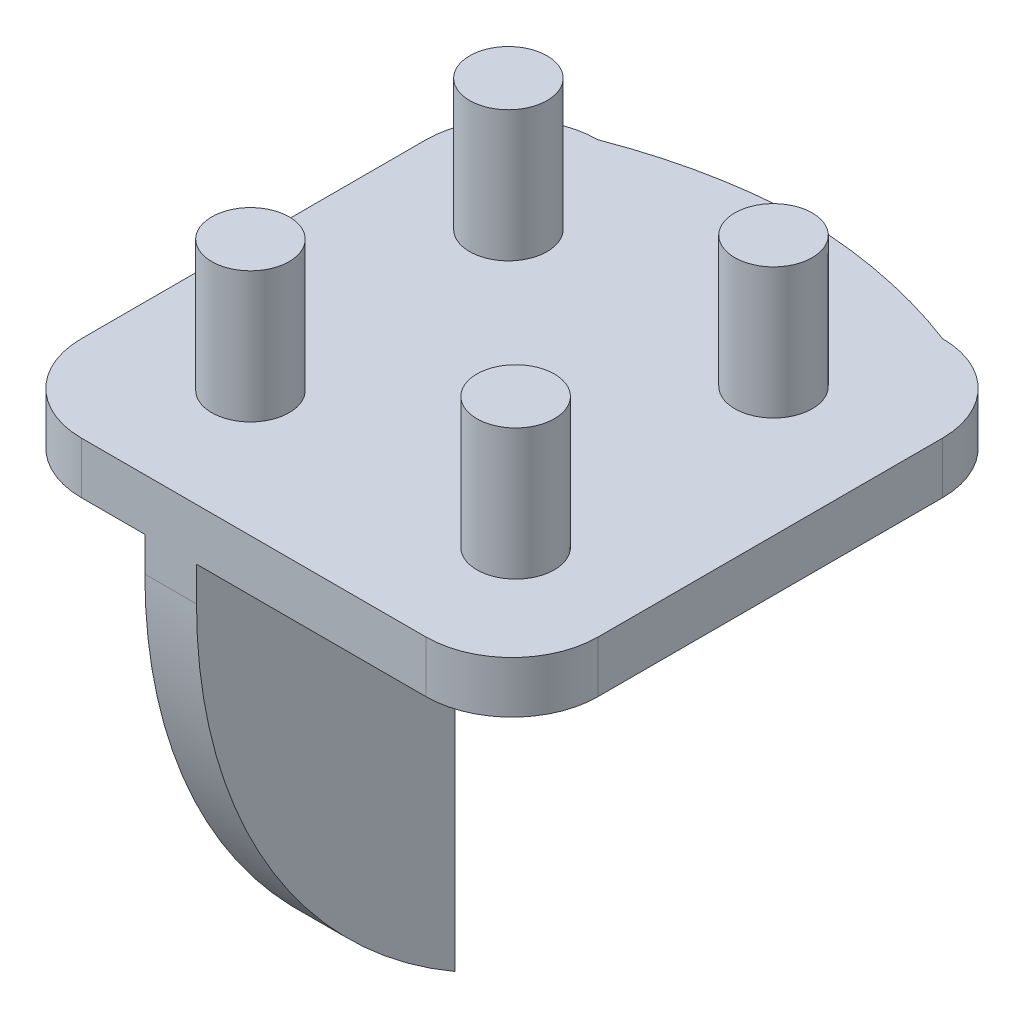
ISO-10303-21;
HEADER;
FILE_DESCRIPTION(('STEP AP214'),'2;1');
FILE_NAME('part.step','',(''),(''),'','','');
FILE_SCHEMA(('AUTOMOTIVE_DESIGN { 1 0 10303 214 1 1 1 1 }'));
ENDSEC;
DATA;
#1=APPLICATION_CONTEXT('core data for automotive mechanical design processes');
#2=APPLICATION_PROTOCOL_DEFINITION('international standard','automotive_design',2000,#1);
#3=PRODUCT_CONTEXT('',#1,'mechanical');
#4=PRODUCT('Part','Part','',(#3));
#5=PRODUCT_RELATED_PRODUCT_CATEGORY('part','',(#4));
#6=PRODUCT_DEFINITION_FORMATION('','',#4);
#7=PRODUCT_DEFINITION_CONTEXT('part definition',#1,'design');
#8=PRODUCT_DEFINITION('design','',#6,#7);
#9=PRODUCT_DEFINITION_SHAPE('','',#8);
#10=(LENGTH_UNIT() NAMED_UNIT(*) SI_UNIT(.MILLI.,.METRE.));
#11=(NAMED_UNIT(*) PLANE_ANGLE_UNIT() SI_UNIT($,.RADIAN.));
#12=(NAMED_UNIT(*) SI_UNIT($,.STERADIAN.) SOLID_ANGLE_UNIT());
#13=UNCERTAINTY_MEASURE_WITH_UNIT(LENGTH_MEASURE(1.E-05),#10,'distance_accuracy_value','');
#14=(GEOMETRIC_REPRESENTATION_CONTEXT(3) GLOBAL_UNCERTAINTY_ASSIGNED_CONTEXT((#13)) GLOBAL_UNIT_ASSIGNED_CONTEXT((#10,
#11,#12)) REPRESENTATION_CONTEXT('',''));
#15=CARTESIAN_POINT('',(0.,0.,0.));
#16=DIRECTION('',(0.,0.,1.));
#17=DIRECTION('',(1.,0.,0.));
#18=AXIS2_PLACEMENT_3D('',#15,#16,#17);
#19=CARTESIAN_POINT('',(-15.,-8.,-11.));
#20=DIRECTION('',(1.,0.,0.));
#21=DIRECTION('',(0.,0.,-1.));
#22=AXIS2_PLACEMENT_3D('',#19,#20,#21);
#23=CYLINDRICAL_SURFACE('',#22,2.);
#24=CARTESIAN_POINT('',(-3.3190616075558,-8.,-11.));
#25=DIRECTION('',(1.,0.,0.));
#26=DIRECTION('',(0.,0.,-1.));
#27=AXIS2_PLACEMENT_3D('',#24,#25,#26);
#28=CIRCLE('',#27,2.);
#29=CARTESIAN_POINT('',(-3.3190616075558,-8.,-13.));
#30=VERTEX_POINT('',#29);
#31=EDGE_CURVE('E454',#30,#30,#28,.T.);
#32=ORIENTED_EDGE('',*,*,#31,.T.);
#33=EDGE_LOOP('',(#32));
#34=FACE_BOUND('',#33,.T.);
#35=CARTESIAN_POINT('',(-4.8190616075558,-8.,-11.));
#36=DIRECTION('',(-1.,0.,0.));
#37=DIRECTION('',(0.,0.,1.));
#38=AXIS2_PLACEMENT_3D('',#35,#36,#37);
#39=CIRCLE('',#38,2.);
#40=CARTESIAN_POINT('',(-4.8190616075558,-8.,-9.00000000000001));
#41=VERTEX_POINT('',#40);
#42=EDGE_CURVE('E280',#41,#41,#39,.F.);
#43=ORIENTED_EDGE('',*,*,#42,.F.);
#44=EDGE_LOOP('',(#43));
#45=FACE_BOUND('',#44,.T.);
#46=ADVANCED_FACE('F33',(#34,#45),#23,.F.);
#47=CARTESIAN_POINT('',(10.,-3.,-10.));
#48=DIRECTION('',(0.,-1.,0.));
#49=DIRECTION('',(0.,0.,-1.));
#50=AXIS2_PLACEMENT_3D('',#47,#48,#49);
#51=PLANE('',#50);
#52=DIRECTION('',(0.,0.,1.));
#53=VECTOR('',#52,1.);
#54=CARTESIAN_POINT('',(-3.31906160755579,-3.,-15.));
#55=LINE('',#54,#53);
#56=CARTESIAN_POINT('',(-3.31906160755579,-3.,-16.7199744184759));
#57=VERTEX_POINT('',#56);
#58=CARTESIAN_POINT('',(-3.3190616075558,-3.,15.));
#59=VERTEX_POINT('',#58);
#60=EDGE_CURVE('E589',#57,#59,#55,.T.);
#61=ORIENTED_EDGE('',*,*,#60,.F.);
#62=CARTESIAN_POINT('',(0.770329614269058,-3.,13.));
#63=DIRECTION('',(0.,-1.,0.));
#64=DIRECTION('',(0.,0.,-1.));
#65=AXIS2_PLACEMENT_3D('',#62,#63,#64);
#66=CIRCLE('',#65,30.);
#67=CARTESIAN_POINT('',(0.,-3.,-16.9901082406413));
#68=VERTEX_POINT('',#67);
#69=EDGE_CURVE('E303',#57,#68,#66,.T.);
#70=ORIENTED_EDGE('',*,*,#69,.T.);
#71=CARTESIAN_POINT('',(-0.770329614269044,-3.,13.));
#72=DIRECTION('',(0.,-1.,0.));
#73=DIRECTION('',(0.,0.,-1.));
#74=AXIS2_PLACEMENT_3D('',#71,#72,#73);
#75=CIRCLE('',#74,30.);
#76=CARTESIAN_POINT('',(1.18093839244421,-3.,-16.9364752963));
#77=VERTEX_POINT('',#76);
#78=EDGE_CURVE('E301',#68,#77,#75,.T.);
#79=ORIENTED_EDGE('',*,*,#78,.T.);
#80=DIRECTION('',(0.,0.,-1.));
#81=VECTOR('',#80,1.);
#82=CARTESIAN_POINT('',(1.18093839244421,-3.,-15.));
#83=LINE('',#82,#81);
#84=CARTESIAN_POINT('',(1.18093839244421,-3.,-5.00000000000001));
#85=VERTEX_POINT('',#84);
#86=EDGE_CURVE('E655',#85,#77,#83,.T.);
#87=ORIENTED_EDGE('',*,*,#86,.F.);
#88=DIRECTION('',(-1.,0.,0.));
#89=VECTOR('',#88,1.);
#90=CARTESIAN_POINT('',(1.18093839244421,-3.,-5.00000000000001));
#91=LINE('',#90,#89);
#92=CARTESIAN_POINT('',(5.18093839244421,-3.,-5.00000000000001));
#93=VERTEX_POINT('',#92);
#94=EDGE_CURVE('E514',#93,#85,#91,.T.);
#95=ORIENTED_EDGE('',*,*,#94,.F.);
#96=DIRECTION('',(0.,0.,1.));
#97=VECTOR('',#96,1.);
#98=CARTESIAN_POINT('',(5.18093839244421,-3.,-15.));
#99=LINE('',#98,#97);
#100=CARTESIAN_POINT('',(5.18093839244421,-3.,-16.4037822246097));
#101=VERTEX_POINT('',#100);
#102=EDGE_CURVE('E531',#101,#93,#99,.T.);
#103=ORIENTED_EDGE('',*,*,#102,.F.);
#104=CARTESIAN_POINT('',(-0.770329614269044,-3.,13.));
#105=DIRECTION('',(0.,-1.,0.));
#106=DIRECTION('',(0.,0.,-1.));
#107=AXIS2_PLACEMENT_3D('',#104,#105,#106);
#108=CIRCLE('',#107,30.);
#109=CARTESIAN_POINT('',(9.99999999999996,-3.,-15.));
#110=VERTEX_POINT('',#109);
#111=EDGE_CURVE('E299',#101,#110,#108,.T.);
#112=ORIENTED_EDGE('',*,*,#111,.T.);
#113=CARTESIAN_POINT('',(10.,-3.,-10.));
#114=DIRECTION('',(0.,1.,0.));
#115=DIRECTION('',(0.,0.,-1.));
#116=AXIS2_PLACEMENT_3D('',#113,#114,#115);
#117=CIRCLE('',#116,5.);
#118=CARTESIAN_POINT('',(15.,-3.,-9.99999999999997));
#119=VERTEX_POINT('',#118);
#120=EDGE_CURVE('E528',#119,#110,#117,.T.);
#121=ORIENTED_EDGE('',*,*,#120,.F.);
#122=DIRECTION('',(0.,0.,-1.));
#123=VECTOR('',#122,1.);
#124=CARTESIAN_POINT('',(15.,-3.,-9.99999999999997));
#125=LINE('',#124,#123);
#126=CARTESIAN_POINT('',(15.,-3.,9.99999999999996));
#127=VERTEX_POINT('',#126);
#128=EDGE_CURVE('E252',#127,#119,#125,.T.);
#129=ORIENTED_EDGE('',*,*,#128,.F.);
#130=CARTESIAN_POINT('',(10.,-3.,9.99999999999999));
#131=DIRECTION('',(0.,1.,0.));
#132=DIRECTION('',(0.,0.,-1.));
#133=AXIS2_PLACEMENT_3D('',#130,#131,#132);
#134=CIRCLE('',#133,5.);
#135=CARTESIAN_POINT('',(9.99999999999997,-3.,15.));
#136=VERTEX_POINT('',#135);
#137=EDGE_CURVE('E554',#136,#127,#134,.T.);
#138=ORIENTED_EDGE('',*,*,#137,.F.);
#139=DIRECTION('',(1.,0.,0.));
#140=VECTOR('',#139,1.);
#141=CARTESIAN_POINT('',(9.99999999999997,-3.,15.));
#142=LINE('',#141,#140);
#143=EDGE_CURVE('E550',#59,#136,#142,.T.);
#144=ORIENTED_EDGE('',*,*,#143,.F.);
#145=EDGE_LOOP('',(#61,#70,#79,#87,#95,#103,#112,#121,#129,#138,#144));
#146=FACE_BOUND('',#145,.T.);
#147=ADVANCED_FACE('F393',(#146),#51,.T.);
#148=CARTESIAN_POINT('',(-10.,-3.,-10.));
#149=DIRECTION('',(0.,1.,0.));
#150=DIRECTION('',(0.,0.,-1.));
#151=AXIS2_PLACEMENT_3D('',#148,#149,#150);
#152=CIRCLE('',#151,5.);
#153=CARTESIAN_POINT('',(-9.99999999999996,-3.,-15.));
#154=VERTEX_POINT('',#153);
#155=CARTESIAN_POINT('',(-15.,-3.,-9.99999999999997));
#156=VERTEX_POINT('',#155);
#157=EDGE_CURVE('E533',#154,#156,#152,.T.);
#158=ORIENTED_EDGE('',*,*,#157,.F.);
#159=CARTESIAN_POINT('',(0.770329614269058,-3.,13.));
#160=DIRECTION('',(0.,-1.,0.));
#161=DIRECTION('',(0.,0.,-1.));
#162=AXIS2_PLACEMENT_3D('',#159,#160,#161);
#163=CIRCLE('',#162,30.);
#164=CARTESIAN_POINT('',(-6.31906160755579,-3.,-16.1503092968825));
#165=VERTEX_POINT('',#164);
#166=EDGE_CURVE('E234',#154,#165,#163,.T.);
#167=ORIENTED_EDGE('',*,*,#166,.T.);
#168=DIRECTION('',(0.,0.,-1.));
#169=VECTOR('',#168,1.);
#170=CARTESIAN_POINT('',(-6.31906160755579,-3.,-15.));
#171=LINE('',#170,#169);
#172=CARTESIAN_POINT('',(-6.31906160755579,-3.,15.));
#173=VERTEX_POINT('',#172);
#174=EDGE_CURVE('E591',#173,#165,#171,.T.);
#175=ORIENTED_EDGE('',*,*,#174,.F.);
#176=CARTESIAN_POINT('',(-9.99999999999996,-3.,15.));
#177=VERTEX_POINT('',#176);
#178=EDGE_CURVE('E551',#177,#173,#142,.T.);
#179=ORIENTED_EDGE('',*,*,#178,.F.);
#180=CARTESIAN_POINT('',(-9.99999999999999,-3.,9.99999999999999));
#181=DIRECTION('',(0.,1.,0.));
#182=DIRECTION('',(0.,0.,-1.));
#183=AXIS2_PLACEMENT_3D('',#180,#181,#182);
#184=CIRCLE('',#183,5.);
#185=CARTESIAN_POINT('',(-15.,-3.,9.99999999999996));
#186=VERTEX_POINT('',#185);
#187=EDGE_CURVE('E547',#186,#177,#184,.T.);
#188=ORIENTED_EDGE('',*,*,#187,.F.);
#189=DIRECTION('',(0.,0.,1.));
#190=VECTOR('',#189,1.);
#191=CARTESIAN_POINT('',(-15.,-3.,-9.99999999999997));
#192=LINE('',#191,#190);
#193=EDGE_CURVE('E536',#156,#186,#192,.T.);
#194=ORIENTED_EDGE('',*,*,#193,.F.);
#195=EDGE_LOOP('',(#158,#167,#175,#179,#188,#194));
#196=FACE_BOUND('',#195,.T.);
#197=ADVANCED_FACE('F396',(#196),#51,.T.);
#198=CARTESIAN_POINT('',(-8.1052135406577,7.6,-7.89563187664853));
#199=DIRECTION('',(0.,-1.,0.));
#200=DIRECTION('',(0.,0.,-1.));
#201=AXIS2_PLACEMENT_3D('',#198,#199,#200);
#202=CYLINDRICAL_SURFACE('',#201,2.25);
#203=CARTESIAN_POINT('',(-8.1052135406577,7.6,-7.89563187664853));
#204=DIRECTION('',(0.,1.,0.));
#205=DIRECTION('',(0.,0.,1.));
#206=AXIS2_PLACEMENT_3D('',#203,#204,#205);
#207=CIRCLE('',#206,2.25);
#208=CARTESIAN_POINT('',(-8.1052135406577,7.6,-10.1456318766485));
#209=VERTEX_POINT('',#208);
#210=EDGE_CURVE('E256',#209,#209,#207,.T.);
#211=CARTESIAN_POINT('',(-8.1052135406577,0.,-7.89563187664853));
#212=DIRECTION('',(0.,1.,0.));
#213=DIRECTION('',(0.,0.,1.));
#214=AXIS2_PLACEMENT_3D('',#211,#212,#213);
#215=CIRCLE('',#214,2.25);
#216=CARTESIAN_POINT('',(-8.1052135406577,0.,-10.1456318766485));
#217=VERTEX_POINT('',#216);
#218=EDGE_CURVE('E260',#217,#217,#215,.T.);
#219=CARTESIAN_POINT('',(-8.1052135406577,7.6,-10.1456318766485));
#220=CARTESIAN_POINT('',(-8.1052135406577,7.52083333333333,-10.1456318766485));
#221=CARTESIAN_POINT('',(-8.1052135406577,7.44166666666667,-10.1456318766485));
#222=CARTESIAN_POINT('',(-8.1052135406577,7.28333333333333,-10.1456318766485));
#223=CARTESIAN_POINT('',(-8.1052135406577,7.20416666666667,-10.1456318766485));
#224=CARTESIAN_POINT('',(-8.1052135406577,7.04583333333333,-10.1456318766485));
#225=CARTESIAN_POINT('',(-8.1052135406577,6.96666666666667,-10.1456318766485));
#226=CARTESIAN_POINT('',(-8.1052135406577,6.80833333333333,-10.1456318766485));
#227=CARTESIAN_POINT('',(-8.1052135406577,6.72916666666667,-10.1456318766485));
#228=CARTESIAN_POINT('',(-8.1052135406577,6.57083333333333,-10.1456318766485));
#229=CARTESIAN_POINT('',(-8.1052135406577,6.49166666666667,-10.1456318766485));
#230=CARTESIAN_POINT('',(-8.1052135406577,6.33333333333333,-10.1456318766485));
#231=CARTESIAN_POINT('',(-8.1052135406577,6.25416666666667,-10.1456318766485));
#232=CARTESIAN_POINT('',(-8.1052135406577,6.09583333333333,-10.1456318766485));
#233=CARTESIAN_POINT('',(-8.1052135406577,6.01666666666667,-10.1456318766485));
#234=CARTESIAN_POINT('',(-8.1052135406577,5.85833333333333,-10.1456318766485));
#235=CARTESIAN_POINT('',(-8.1052135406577,5.77916666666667,-10.1456318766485));
#236=CARTESIAN_POINT('',(-8.1052135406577,5.62083333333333,-10.1456318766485));
#237=CARTESIAN_POINT('',(-8.1052135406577,5.54166666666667,-10.1456318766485));
#238=CARTESIAN_POINT('',(-8.1052135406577,5.38333333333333,-10.1456318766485));
#239=CARTESIAN_POINT('',(-8.1052135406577,5.30416666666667,-10.1456318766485));
#240=CARTESIAN_POINT('',(-8.1052135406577,5.14583333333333,-10.1456318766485));
#241=CARTESIAN_POINT('',(-8.1052135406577,5.06666666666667,-10.1456318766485));
#242=CARTESIAN_POINT('',(-8.1052135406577,4.90833333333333,-10.1456318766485));
#243=CARTESIAN_POINT('',(-8.1052135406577,4.82916666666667,-10.1456318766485));
#244=CARTESIAN_POINT('',(-8.1052135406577,4.67083333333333,-10.1456318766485));
#245=CARTESIAN_POINT('',(-8.1052135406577,4.59166666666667,-10.1456318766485));
#246=CARTESIAN_POINT('',(-8.1052135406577,4.43333333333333,-10.1456318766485));
#247=CARTESIAN_POINT('',(-8.1052135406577,4.35416666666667,-10.1456318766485));
#248=CARTESIAN_POINT('',(-8.1052135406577,4.19583333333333,-10.1456318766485));
#249=CARTESIAN_POINT('',(-8.1052135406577,4.11666666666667,-10.1456318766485));
#250=CARTESIAN_POINT('',(-8.1052135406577,3.95833333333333,-10.1456318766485));
#251=CARTESIAN_POINT('',(-8.1052135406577,3.87916666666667,-10.1456318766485));
#252=CARTESIAN_POINT('',(-8.1052135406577,3.72083333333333,-10.1456318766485));
#253=CARTESIAN_POINT('',(-8.1052135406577,3.64166666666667,-10.1456318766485));
#254=CARTESIAN_POINT('',(-8.1052135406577,3.48333333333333,-10.1456318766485));
#255=CARTESIAN_POINT('',(-8.1052135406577,3.40416666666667,-10.1456318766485));
#256=CARTESIAN_POINT('',(-8.1052135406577,3.24583333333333,-10.1456318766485));
#257=CARTESIAN_POINT('',(-8.1052135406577,3.16666666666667,-10.1456318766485));
#258=CARTESIAN_POINT('',(-8.1052135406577,3.00833333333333,-10.1456318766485));
#259=CARTESIAN_POINT('',(-8.1052135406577,2.92916666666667,-10.1456318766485));
#260=CARTESIAN_POINT('',(-8.1052135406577,2.77083333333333,-10.1456318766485));
#261=CARTESIAN_POINT('',(-8.1052135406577,2.69166666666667,-10.1456318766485));
#262=CARTESIAN_POINT('',(-8.1052135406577,2.53333333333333,-10.1456318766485));
#263=CARTESIAN_POINT('',(-8.1052135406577,2.45416666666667,-10.1456318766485));
#264=CARTESIAN_POINT('',(-8.1052135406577,2.29583333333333,-10.1456318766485));
#265=CARTESIAN_POINT('',(-8.1052135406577,2.21666666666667,-10.1456318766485));
#266=CARTESIAN_POINT('',(-8.1052135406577,2.05833333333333,-10.1456318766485));
#267=CARTESIAN_POINT('',(-8.1052135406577,1.97916666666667,-10.1456318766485));
#268=CARTESIAN_POINT('',(-8.1052135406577,1.82083333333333,-10.1456318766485));
#269=CARTESIAN_POINT('',(-8.1052135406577,1.74166666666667,-10.1456318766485));
#270=CARTESIAN_POINT('',(-8.1052135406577,1.58333333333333,-10.1456318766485));
#271=CARTESIAN_POINT('',(-8.1052135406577,1.50416666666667,-10.1456318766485));
#272=CARTESIAN_POINT('',(-8.1052135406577,1.34583333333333,-10.1456318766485));
#273=CARTESIAN_POINT('',(-8.1052135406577,1.26666666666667,-10.1456318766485));
#274=CARTESIAN_POINT('',(-8.1052135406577,1.10833333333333,-10.1456318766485));
#275=CARTESIAN_POINT('',(-8.1052135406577,1.02916666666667,-10.1456318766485));
#276=CARTESIAN_POINT('',(-8.1052135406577,0.870833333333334,-10.1456318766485));
#277=CARTESIAN_POINT('',(-8.1052135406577,0.791666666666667,-10.1456318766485));
#278=CARTESIAN_POINT('',(-8.1052135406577,0.633333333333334,-10.1456318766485));
#279=CARTESIAN_POINT('',(-8.1052135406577,0.554166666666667,-10.1456318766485));
#280=CARTESIAN_POINT('',(-8.1052135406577,0.395833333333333,-10.1456318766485));
#281=CARTESIAN_POINT('',(-8.1052135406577,0.316666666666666,-10.1456318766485));
#282=CARTESIAN_POINT('',(-8.1052135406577,0.158333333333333,-10.1456318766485));
#283=CARTESIAN_POINT('',(-8.1052135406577,0.0791666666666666,-10.1456318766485));
#284=CARTESIAN_POINT('',(-8.1052135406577,0.,-10.1456318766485));
#285=B_SPLINE_CURVE_WITH_KNOTS('',3,(#219,#220,#221,#222,#223,#224,#225,#226,#227,#228,#229,
#230,#231,#232,#233,#234,#235,#236,#237,#238,#239,#240,#241,#242,#243,#244,#245,#246,#247,#248,
#249,#250,#251,#252,#253,#254,#255,#256,#257,#258,#259,#260,#261,#262,#263,#264,#265,#266,#267,
#268,#269,#270,#271,#272,#273,#274,#275,#276,#277,#278,#279,#280,#281,#282,#283,#284),
.UNSPECIFIED.,.F.,.F.,(4,2,2,2,2,2,2,2,2,2,2,2,2,2,2,2,2,2,2,2,2,2,2,2,2,2,2,2,2,2,2,2,4),(0.,
0.237500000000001,0.475000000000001,0.7125,0.95,1.1875,1.425,1.6625,1.9,2.1375,2.375,2.6125,
2.85,3.0875,3.325,3.5625,3.8,4.0375,4.275,4.5125,4.75,4.9875,5.225,5.4625,5.7,5.9375,6.175,
6.4125,6.65,6.8875,7.125,7.3625,7.6),.UNSPECIFIED.);
#286=EDGE_CURVE('BSEAM430',#209,#217,#285,.T.);
#287=ORIENTED_EDGE('',*,*,#210,.F.);
#288=ORIENTED_EDGE('',*,*,#218,.T.);
#289=ORIENTED_EDGE('',*,*,#286,.T.);
#290=ORIENTED_EDGE('',*,*,#286,.F.);
#291=EDGE_LOOP('',(#287,#289,#288,#290));
#292=FACE_BOUND('',#291,.T.);
#293=ADVANCED_FACE('F430',(#292),#202,.T.);
#294=CARTESIAN_POINT('',(-8.1052135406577,7.6,-7.89563187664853));
#295=DIRECTION('',(0.,1.,0.));
#296=DIRECTION('',(0.,0.,1.));
#297=AXIS2_PLACEMENT_3D('',#294,#295,#296);
#298=PLANE('',#297);
#299=ORIENTED_EDGE('',*,*,#210,.T.);
#300=EDGE_LOOP('',(#299));
#301=FACE_BOUND('',#300,.T.);
#302=ADVANCED_FACE('F426',(#301),#298,.T.);
#303=CARTESIAN_POINT('',(10.,-3.,-10.));
#304=DIRECTION('',(0.,1.,0.));
#305=DIRECTION('',(0.,0.,1.));
#306=AXIS2_PLACEMENT_3D('',#303,#304,#305);
#307=CYLINDRICAL_SURFACE('',#306,5.);
#308=CARTESIAN_POINT('',(10.,0.,-10.));
#309=DIRECTION('',(0.,1.,0.));
#310=DIRECTION('',(0.,0.,-1.));
#311=AXIS2_PLACEMENT_3D('',#308,#309,#310);
#312=CIRCLE('',#311,5.);
#313=CARTESIAN_POINT('',(15.,0.,-9.99999999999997));
#314=VERTEX_POINT('',#313);
#315=CARTESIAN_POINT('',(9.99999999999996,0.,-15.));
#316=VERTEX_POINT('',#315);
#317=EDGE_CURVE('E245',#314,#316,#312,.T.);
#318=ORIENTED_EDGE('',*,*,#317,.F.);
#319=DIRECTION('',(0.,1.,0.));
#320=VECTOR('',#319,1.);
#321=CARTESIAN_POINT('',(15.,-3.,-9.99999999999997));
#322=LINE('',#321,#320);
#323=EDGE_CURVE('E263',#119,#314,#322,.T.);
#324=ORIENTED_EDGE('',*,*,#323,.F.);
#325=ORIENTED_EDGE('',*,*,#120,.T.);
#326=DIRECTION('',(0.,1.,0.));
#327=VECTOR('',#326,1.);
#328=CARTESIAN_POINT('',(9.99999999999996,-3.,-15.));
#329=LINE('',#328,#327);
#330=EDGE_CURVE('E248',#110,#316,#329,.T.);
#331=ORIENTED_EDGE('',*,*,#330,.T.);
#332=EDGE_LOOP('',(#318,#324,#325,#331));
#333=FACE_BOUND('',#332,.T.);
#334=ADVANCED_FACE('F405',(#333),#307,.T.);
#335=CARTESIAN_POINT('',(15.,-3.,-9.99999999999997));
#336=DIRECTION('',(1.,0.,0.));
#337=DIRECTION('',(0.,0.,-1.));
#338=AXIS2_PLACEMENT_3D('',#335,#336,#337);
#339=PLANE('',#338);
#340=DIRECTION('',(0.,0.,-1.));
#341=VECTOR('',#340,1.);
#342=CARTESIAN_POINT('',(15.,0.,-9.99999999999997));
#343=LINE('',#342,#341);
#344=CARTESIAN_POINT('',(15.,0.,9.99999999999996));
#345=VERTEX_POINT('',#344);
#346=EDGE_CURVE('E534',#345,#314,#343,.T.);
#347=ORIENTED_EDGE('',*,*,#346,.F.);
#348=DIRECTION('',(0.,1.,0.));
#349=VECTOR('',#348,1.);
#350=CARTESIAN_POINT('',(15.,-3.,9.99999999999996));
#351=LINE('',#350,#349);
#352=EDGE_CURVE('E569',#127,#345,#351,.T.);
#353=ORIENTED_EDGE('',*,*,#352,.F.);
#354=ORIENTED_EDGE('',*,*,#128,.T.);
#355=ORIENTED_EDGE('',*,*,#323,.T.);
#356=EDGE_LOOP('',(#347,#353,#354,#355));
#357=FACE_BOUND('',#356,.T.);
#358=ADVANCED_FACE('F401',(#357),#339,.T.);
#359=CARTESIAN_POINT('',(10.,-3.,9.99999999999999));
#360=DIRECTION('',(0.,1.,0.));
#361=DIRECTION('',(0.,0.,1.));
#362=AXIS2_PLACEMENT_3D('',#359,#360,#361);
#363=CYLINDRICAL_SURFACE('',#362,5.);
#364=CARTESIAN_POINT('',(10.,0.,9.99999999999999));
#365=DIRECTION('',(0.,1.,0.));
#366=DIRECTION('',(0.,0.,-1.));
#367=AXIS2_PLACEMENT_3D('',#364,#365,#366);
#368=CIRCLE('',#367,5.);
#369=CARTESIAN_POINT('',(9.99999999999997,0.,15.));
#370=VERTEX_POINT('',#369);
#371=EDGE_CURVE('E539',#370,#345,#368,.T.);
#372=ORIENTED_EDGE('',*,*,#371,.F.);
#373=DIRECTION('',(0.,1.,0.));
#374=VECTOR('',#373,1.);
#375=CARTESIAN_POINT('',(9.99999999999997,-3.,15.));
#376=LINE('',#375,#374);
#377=EDGE_CURVE('E571',#136,#370,#376,.T.);
#378=ORIENTED_EDGE('',*,*,#377,.F.);
#379=ORIENTED_EDGE('',*,*,#137,.T.);
#380=ORIENTED_EDGE('',*,*,#352,.T.);
#381=EDGE_LOOP('',(#372,#378,#379,#380));
#382=FACE_BOUND('',#381,.T.);
#383=ADVANCED_FACE('F404',(#382),#363,.T.);
#384=CARTESIAN_POINT('',(9.99999999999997,-3.,15.));
#385=DIRECTION('',(0.,0.,1.));
#386=DIRECTION('',(1.,0.,0.));
#387=AXIS2_PLACEMENT_3D('',#384,#385,#386);
#388=PLANE('',#387);
#389=DIRECTION('',(1.,0.,0.));
#390=VECTOR('',#389,1.);
#391=CARTESIAN_POINT('',(9.99999999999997,0.,15.));
#392=LINE('',#391,#390);
#393=CARTESIAN_POINT('',(-9.99999999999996,0.,15.));
#394=VERTEX_POINT('',#393);
#395=EDGE_CURVE('E563',#394,#370,#392,.T.);
#396=ORIENTED_EDGE('',*,*,#395,.F.);
#397=DIRECTION('',(0.,1.,0.));
#398=VECTOR('',#397,1.);
#399=CARTESIAN_POINT('',(-9.99999999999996,-3.,15.));
#400=LINE('',#399,#398);
#401=EDGE_CURVE('E573',#177,#394,#400,.T.);
#402=ORIENTED_EDGE('',*,*,#401,.F.);
#403=ORIENTED_EDGE('',*,*,#178,.T.);
#404=DIRECTION('',(0.,1.,0.));
#405=VECTOR('',#404,1.);
#406=CARTESIAN_POINT('',(-6.3190616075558,-5.,15.));
#407=LINE('',#406,#405);
#408=CARTESIAN_POINT('',(-6.3190616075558,-5.,15.));
#409=VERTEX_POINT('',#408);
#410=EDGE_CURVE('E594',#409,#173,#407,.T.);
#411=ORIENTED_EDGE('',*,*,#410,.F.);
#412=DIRECTION('',(-1.,0.,0.));
#413=VECTOR('',#412,1.);
#414=CARTESIAN_POINT('',(-6.3190616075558,-5.,15.));
#415=LINE('',#414,#413);
#416=CARTESIAN_POINT('',(-3.3190616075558,-5.,15.));
#417=VERTEX_POINT('',#416);
#418=EDGE_CURVE('E590',#417,#409,#415,.T.);
#419=ORIENTED_EDGE('',*,*,#418,.F.);
#420=DIRECTION('',(0.,1.,0.));
#421=VECTOR('',#420,1.);
#422=CARTESIAN_POINT('',(-3.3190616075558,-5.,15.));
#423=LINE('',#422,#421);
#424=EDGE_CURVE('E602',#417,#59,#423,.T.);
#425=ORIENTED_EDGE('',*,*,#424,.T.);
#426=ORIENTED_EDGE('',*,*,#143,.T.);
#427=ORIENTED_EDGE('',*,*,#377,.T.);
#428=EDGE_LOOP('',(#396,#402,#403,#411,#419,#425,#426,#427));
#429=FACE_BOUND('',#428,.T.);
#430=ADVANCED_FACE('F409',(#429),#388,.T.);
#431=CARTESIAN_POINT('',(-9.99999999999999,-3.,9.99999999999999));
#432=DIRECTION('',(0.,1.,0.));
#433=DIRECTION('',(0.,0.,1.));
#434=AXIS2_PLACEMENT_3D('',#431,#432,#433);
#435=CYLINDRICAL_SURFACE('',#434,5.);
#436=CARTESIAN_POINT('',(-9.99999999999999,0.,9.99999999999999));
#437=DIRECTION('',(0.,1.,0.));
#438=DIRECTION('',(0.,0.,-1.));
#439=AXIS2_PLACEMENT_3D('',#436,#437,#438);
#440=CIRCLE('',#439,5.);
#441=CARTESIAN_POINT('',(-15.,0.,9.99999999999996));
#442=VERTEX_POINT('',#441);
#443=EDGE_CURVE('E560',#442,#394,#440,.T.);
#444=ORIENTED_EDGE('',*,*,#443,.F.);
#445=DIRECTION('',(0.,1.,0.));
#446=VECTOR('',#445,1.);
#447=CARTESIAN_POINT('',(-15.,-3.,9.99999999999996));
#448=LINE('',#447,#446);
#449=EDGE_CURVE('E250',#186,#442,#448,.T.);
#450=ORIENTED_EDGE('',*,*,#449,.F.);
#451=ORIENTED_EDGE('',*,*,#187,.T.);
#452=ORIENTED_EDGE('',*,*,#401,.T.);
#453=EDGE_LOOP('',(#444,#450,#451,#452));
#454=FACE_BOUND('',#453,.T.);
#455=ADVANCED_FACE('F413',(#454),#435,.T.);
#456=CARTESIAN_POINT('',(-15.,-3.,-9.99999999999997));
#457=DIRECTION('',(-1.,0.,0.));
#458=DIRECTION('',(0.,0.,1.));
#459=AXIS2_PLACEMENT_3D('',#456,#457,#458);
#460=PLANE('',#459);
#461=DIRECTION('',(0.,0.,1.));
#462=VECTOR('',#461,1.);
#463=CARTESIAN_POINT('',(-15.,0.,-9.99999999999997));
#464=LINE('',#463,#462);
#465=CARTESIAN_POINT('',(-15.,0.,-9.99999999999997));
#466=VERTEX_POINT('',#465);
#467=EDGE_CURVE('E244',#466,#442,#464,.T.);
#468=ORIENTED_EDGE('',*,*,#467,.F.);
#469=DIRECTION('',(0.,1.,0.));
#470=VECTOR('',#469,1.);
#471=CARTESIAN_POINT('',(-15.,-3.,-9.99999999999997));
#472=LINE('',#471,#470);
#473=EDGE_CURVE('E242',#156,#466,#472,.T.);
#474=ORIENTED_EDGE('',*,*,#473,.F.);
#475=ORIENTED_EDGE('',*,*,#193,.T.);
#476=ORIENTED_EDGE('',*,*,#449,.T.);
#477=EDGE_LOOP('',(#468,#474,#475,#476));
#478=FACE_BOUND('',#477,.T.);
#479=ADVANCED_FACE('F417',(#478),#460,.T.);
#480=CARTESIAN_POINT('',(-10.,-3.,-10.));
#481=DIRECTION('',(0.,1.,0.));
#482=DIRECTION('',(0.,0.,1.));
#483=AXIS2_PLACEMENT_3D('',#480,#481,#482);
#484=CYLINDRICAL_SURFACE('',#483,5.);
#485=CARTESIAN_POINT('',(-10.,0.,-10.));
#486=DIRECTION('',(0.,1.,0.));
#487=DIRECTION('',(0.,0.,-1.));
#488=AXIS2_PLACEMENT_3D('',#485,#486,#487);
#489=CIRCLE('',#488,5.);
#490=CARTESIAN_POINT('',(-9.99999999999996,0.,-15.));
#491=VERTEX_POINT('',#490);
#492=EDGE_CURVE('E227',#491,#466,#489,.T.);
#493=ORIENTED_EDGE('',*,*,#492,.F.);
#494=DIRECTION('',(0.,1.,0.));
#495=VECTOR('',#494,1.);
#496=CARTESIAN_POINT('',(-9.99999999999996,-3.,-15.));
#497=LINE('',#496,#495);
#498=EDGE_CURVE('E240',#154,#491,#497,.T.);
#499=ORIENTED_EDGE('',*,*,#498,.F.);
#500=ORIENTED_EDGE('',*,*,#157,.T.);
#501=ORIENTED_EDGE('',*,*,#473,.T.);
#502=EDGE_LOOP('',(#493,#499,#500,#501));
#503=FACE_BOUND('',#502,.T.);
#504=ADVANCED_FACE('F238',(#503),#484,.T.);
#505=CARTESIAN_POINT('',(10.,0.,-10.));
#506=DIRECTION('',(0.,-1.,0.));
#507=DIRECTION('',(0.,0.,-1.));
#508=AXIS2_PLACEMENT_3D('',#505,#506,#507);
#509=PLANE('',#508);
#510=CARTESIAN_POINT('',(-7.494128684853,0.,7.6923947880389));
#511=DIRECTION('',(0.,-1.,0.));
#512=DIRECTION('',(0.,0.,-1.));
#513=AXIS2_PLACEMENT_3D('',#510,#511,#512);
#514=CIRCLE('',#513,2.25000000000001);
#515=CARTESIAN_POINT('',(-7.494128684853,0.,5.44239478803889));
#516=VERTEX_POINT('',#515);
#517=EDGE_CURVE('E269',#516,#516,#514,.F.);
#518=ORIENTED_EDGE('',*,*,#517,.F.);
#519=EDGE_LOOP('',(#518));
#520=FACE_BOUND('',#519,.T.);
#521=CARTESIAN_POINT('',(8.105871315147,0.,7.89627264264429));
#522=DIRECTION('',(0.,-1.,0.));
#523=DIRECTION('',(0.,0.,-1.));
#524=AXIS2_PLACEMENT_3D('',#521,#522,#523);
#525=CIRCLE('',#524,2.25000000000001);
#526=CARTESIAN_POINT('',(8.105871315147,0.,5.64627264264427));
#527=VERTEX_POINT('',#526);
#528=EDGE_CURVE('E266',#527,#527,#525,.F.);
#529=ORIENTED_EDGE('',*,*,#528,.F.);
#530=EDGE_LOOP('',(#529));
#531=FACE_BOUND('',#530,.T.);
#532=CARTESIAN_POINT('',(7.49345346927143,0.,-7.69170170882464));
#533=DIRECTION('',(0.,-1.,0.));
#534=DIRECTION('',(0.,0.,-1.));
#535=AXIS2_PLACEMENT_3D('',#532,#533,#534);
#536=CIRCLE('',#535,2.25000000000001);
#537=CARTESIAN_POINT('',(7.49345346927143,0.,-9.94170170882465));
#538=VERTEX_POINT('',#537);
#539=EDGE_CURVE('E259',#538,#538,#536,.F.);
#540=ORIENTED_EDGE('',*,*,#539,.F.);
#541=EDGE_LOOP('',(#540));
#542=FACE_BOUND('',#541,.T.);
#543=ORIENTED_EDGE('',*,*,#218,.F.);
#544=EDGE_LOOP('',(#543));
#545=FACE_BOUND('',#544,.T.);
#546=CARTESIAN_POINT('',(-0.770329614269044,0.,13.));
#547=DIRECTION('',(0.,-1.,0.));
#548=DIRECTION('',(0.,0.,-1.));
#549=AXIS2_PLACEMENT_3D('',#546,#547,#548);
#550=CIRCLE('',#549,30.);
#551=CARTESIAN_POINT('',(0.,0.,-16.9901082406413));
#552=VERTEX_POINT('',#551);
#553=EDGE_CURVE('E230',#316,#552,#550,.F.);
#554=ORIENTED_EDGE('',*,*,#553,.T.);
#555=CARTESIAN_POINT('',(0.770329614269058,0.,13.));
#556=DIRECTION('',(0.,-1.,0.));
#557=DIRECTION('',(0.,0.,-1.));
#558=AXIS2_PLACEMENT_3D('',#555,#556,#557);
#559=CIRCLE('',#558,30.);
#560=EDGE_CURVE('E223',#552,#491,#559,.F.);
#561=ORIENTED_EDGE('',*,*,#560,.T.);
#562=ORIENTED_EDGE('',*,*,#492,.T.);
#563=ORIENTED_EDGE('',*,*,#467,.T.);
#564=ORIENTED_EDGE('',*,*,#443,.T.);
#565=ORIENTED_EDGE('',*,*,#395,.T.);
#566=ORIENTED_EDGE('',*,*,#371,.T.);
#567=ORIENTED_EDGE('',*,*,#346,.T.);
#568=ORIENTED_EDGE('',*,*,#317,.T.);
#569=EDGE_LOOP('',(#554,#561,#562,#563,#564,#565,#566,#567,#568));
#570=FACE_BOUND('',#569,.T.);
#571=ADVANCED_FACE('F225',(#520,#531,#542,#545,#570),#509,.F.);
#572=CARTESIAN_POINT('',(7.49345346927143,7.6,-7.69170170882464));
#573=DIRECTION('',(0.,-1.,0.));
#574=DIRECTION('',(0.,0.,-1.));
#575=AXIS2_PLACEMENT_3D('',#572,#573,#574);
#576=CYLINDRICAL_SURFACE('',#575,2.25000000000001);
#577=CARTESIAN_POINT('',(7.49345346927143,7.6,-7.69170170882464));
#578=DIRECTION('',(0.,1.,0.));
#579=DIRECTION('',(0.,0.,1.));
#580=AXIS2_PLACEMENT_3D('',#577,#578,#579);
#581=CIRCLE('',#580,2.25000000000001);
#582=CARTESIAN_POINT('',(7.49345346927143,7.6,-9.94170170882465));
#583=VERTEX_POINT('',#582);
#584=EDGE_CURVE('E542',#583,#583,#581,.T.);
#585=CARTESIAN_POINT('',(7.49345346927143,7.6,-9.94170170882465));
#586=CARTESIAN_POINT('',(7.49345346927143,7.52083333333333,-9.94170170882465));
#587=CARTESIAN_POINT('',(7.49345346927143,7.44166666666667,-9.94170170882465));
#588=CARTESIAN_POINT('',(7.49345346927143,7.28333333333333,-9.94170170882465));
#589=CARTESIAN_POINT('',(7.49345346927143,7.20416666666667,-9.94170170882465));
#590=CARTESIAN_POINT('',(7.49345346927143,7.04583333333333,-9.94170170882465));
#591=CARTESIAN_POINT('',(7.49345346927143,6.96666666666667,-9.94170170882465));
#592=CARTESIAN_POINT('',(7.49345346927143,6.80833333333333,-9.94170170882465));
#593=CARTESIAN_POINT('',(7.49345346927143,6.72916666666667,-9.94170170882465));
#594=CARTESIAN_POINT('',(7.49345346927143,6.57083333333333,-9.94170170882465));
#595=CARTESIAN_POINT('',(7.49345346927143,6.49166666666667,-9.94170170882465));
#596=CARTESIAN_POINT('',(7.49345346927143,6.33333333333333,-9.94170170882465));
#597=CARTESIAN_POINT('',(7.49345346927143,6.25416666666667,-9.94170170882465));
#598=CARTESIAN_POINT('',(7.49345346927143,6.09583333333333,-9.94170170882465));
#599=CARTESIAN_POINT('',(7.49345346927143,6.01666666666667,-9.94170170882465));
#600=CARTESIAN_POINT('',(7.49345346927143,5.85833333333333,-9.94170170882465));
#601=CARTESIAN_POINT('',(7.49345346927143,5.77916666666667,-9.94170170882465));
#602=CARTESIAN_POINT('',(7.49345346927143,5.62083333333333,-9.94170170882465));
#603=CARTESIAN_POINT('',(7.49345346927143,5.54166666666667,-9.94170170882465));
#604=CARTESIAN_POINT('',(7.49345346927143,5.38333333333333,-9.94170170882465));
#605=CARTESIAN_POINT('',(7.49345346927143,5.30416666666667,-9.94170170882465));
#606=CARTESIAN_POINT('',(7.49345346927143,5.14583333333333,-9.94170170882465));
#607=CARTESIAN_POINT('',(7.49345346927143,5.06666666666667,-9.94170170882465));
#608=CARTESIAN_POINT('',(7.49345346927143,4.90833333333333,-9.94170170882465));
#609=CARTESIAN_POINT('',(7.49345346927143,4.82916666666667,-9.94170170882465));
#610=CARTESIAN_POINT('',(7.49345346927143,4.67083333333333,-9.94170170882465));
#611=CARTESIAN_POINT('',(7.49345346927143,4.59166666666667,-9.94170170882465));
#612=CARTESIAN_POINT('',(7.49345346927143,4.43333333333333,-9.94170170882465));
#613=CARTESIAN_POINT('',(7.49345346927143,4.35416666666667,-9.94170170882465));
#614=CARTESIAN_POINT('',(7.49345346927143,4.19583333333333,-9.94170170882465));
#615=CARTESIAN_POINT('',(7.49345346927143,4.11666666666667,-9.94170170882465));
#616=CARTESIAN_POINT('',(7.49345346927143,3.95833333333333,-9.94170170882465));
#617=CARTESIAN_POINT('',(7.49345346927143,3.87916666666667,-9.94170170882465));
#618=CARTESIAN_POINT('',(7.49345346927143,3.72083333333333,-9.94170170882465));
#619=CARTESIAN_POINT('',(7.49345346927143,3.64166666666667,-9.94170170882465));
#620=CARTESIAN_POINT('',(7.49345346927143,3.48333333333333,-9.94170170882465));
#621=CARTESIAN_POINT('',(7.49345346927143,3.40416666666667,-9.94170170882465));
#622=CARTESIAN_POINT('',(7.49345346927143,3.24583333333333,-9.94170170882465));
#623=CARTESIAN_POINT('',(7.49345346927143,3.16666666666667,-9.94170170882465));
#624=CARTESIAN_POINT('',(7.49345346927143,3.00833333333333,-9.94170170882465));
#625=CARTESIAN_POINT('',(7.49345346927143,2.92916666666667,-9.94170170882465));
#626=CARTESIAN_POINT('',(7.49345346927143,2.77083333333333,-9.94170170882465));
#627=CARTESIAN_POINT('',(7.49345346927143,2.69166666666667,-9.94170170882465));
#628=CARTESIAN_POINT('',(7.49345346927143,2.53333333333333,-9.94170170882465));
#629=CARTESIAN_POINT('',(7.49345346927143,2.45416666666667,-9.94170170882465));
#630=CARTESIAN_POINT('',(7.49345346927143,2.29583333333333,-9.94170170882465));
#631=CARTESIAN_POINT('',(7.49345346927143,2.21666666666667,-9.94170170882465));
#632=CARTESIAN_POINT('',(7.49345346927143,2.05833333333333,-9.94170170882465));
#633=CARTESIAN_POINT('',(7.49345346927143,1.97916666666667,-9.94170170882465));
#634=CARTESIAN_POINT('',(7.49345346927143,1.82083333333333,-9.94170170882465));
#635=CARTESIAN_POINT('',(7.49345346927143,1.74166666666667,-9.94170170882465));
#636=CARTESIAN_POINT('',(7.49345346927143,1.58333333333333,-9.94170170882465));
#637=CARTESIAN_POINT('',(7.49345346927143,1.50416666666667,-9.94170170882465));
#638=CARTESIAN_POINT('',(7.49345346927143,1.34583333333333,-9.94170170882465));
#639=CARTESIAN_POINT('',(7.49345346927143,1.26666666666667,-9.94170170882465));
#640=CARTESIAN_POINT('',(7.49345346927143,1.10833333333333,-9.94170170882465));
#641=CARTESIAN_POINT('',(7.49345346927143,1.02916666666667,-9.94170170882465));
#642=CARTESIAN_POINT('',(7.49345346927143,0.870833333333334,-9.94170170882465));
#643=CARTESIAN_POINT('',(7.49345346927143,0.791666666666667,-9.94170170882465));
#644=CARTESIAN_POINT('',(7.49345346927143,0.633333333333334,-9.94170170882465));
#645=CARTESIAN_POINT('',(7.49345346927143,0.554166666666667,-9.94170170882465));
#646=CARTESIAN_POINT('',(7.49345346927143,0.395833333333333,-9.94170170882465));
#647=CARTESIAN_POINT('',(7.49345346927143,0.316666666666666,-9.94170170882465));
#648=CARTESIAN_POINT('',(7.49345346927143,0.158333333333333,-9.94170170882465));
#649=CARTESIAN_POINT('',(7.49345346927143,0.0791666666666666,-9.94170170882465));
#650=CARTESIAN_POINT('',(7.49345346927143,0.,-9.94170170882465));
#651=B_SPLINE_CURVE_WITH_KNOTS('',3,(#585,#586,#587,#588,#589,#590,#591,#592,#593,#594,#595,
#596,#597,#598,#599,#600,#601,#602,#603,#604,#605,#606,#607,#608,#609,#610,#611,#612,#613,#614,
#615,#616,#617,#618,#619,#620,#621,#622,#623,#624,#625,#626,#627,#628,#629,#630,#631,#632,#633,
#634,#635,#636,#637,#638,#639,#640,#641,#642,#643,#644,#645,#646,#647,#648,#649,#650),
.UNSPECIFIED.,.F.,.F.,(4,2,2,2,2,2,2,2,2,2,2,2,2,2,2,2,2,2,2,2,2,2,2,2,2,2,2,2,2,2,2,2,4),(0.,
0.237500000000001,0.475000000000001,0.7125,0.95,1.1875,1.425,1.6625,1.9,2.1375,2.375,2.6125,
2.85,3.0875,3.325,3.5625,3.8,4.0375,4.275,4.5125,4.75,4.9875,5.225,5.4625,5.7,5.9375,6.175,
6.4125,6.65,6.8875,7.125,7.3625,7.6),.UNSPECIFIED.);
#652=EDGE_CURVE('BSEAM386',#583,#538,#651,.T.);
#653=ORIENTED_EDGE('',*,*,#584,.F.);
#654=ORIENTED_EDGE('',*,*,#539,.T.);
#655=ORIENTED_EDGE('',*,*,#652,.T.);
#656=ORIENTED_EDGE('',*,*,#652,.F.);
#657=EDGE_LOOP('',(#653,#655,#654,#656));
#658=FACE_BOUND('',#657,.T.);
#659=ADVANCED_FACE('F386',(#658),#576,.T.);
#660=CARTESIAN_POINT('',(7.49345346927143,7.6,-7.69170170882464));
#661=DIRECTION('',(0.,1.,0.));
#662=DIRECTION('',(0.,0.,1.));
#663=AXIS2_PLACEMENT_3D('',#660,#661,#662);
#664=PLANE('',#663);
#665=ORIENTED_EDGE('',*,*,#584,.T.);
#666=EDGE_LOOP('',(#665));
#667=FACE_BOUND('',#666,.T.);
#668=ADVANCED_FACE('F381',(#667),#664,.T.);
#669=CARTESIAN_POINT('',(8.105871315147,7.6,7.89627264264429));
#670=DIRECTION('',(0.,-1.,0.));
#671=DIRECTION('',(0.,0.,-1.));
#672=AXIS2_PLACEMENT_3D('',#669,#670,#671);
#673=CYLINDRICAL_SURFACE('',#672,2.25000000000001);
#674=CARTESIAN_POINT('',(8.105871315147,7.6,7.89627264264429));
#675=DIRECTION('',(0.,1.,0.));
#676=DIRECTION('',(0.,0.,1.));
#677=AXIS2_PLACEMENT_3D('',#674,#675,#676);
#678=CIRCLE('',#677,2.25000000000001);
#679=CARTESIAN_POINT('',(8.105871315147,7.6,5.64627264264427));
#680=VERTEX_POINT('',#679);
#681=EDGE_CURVE('E606',#680,#680,#678,.T.);
#682=CARTESIAN_POINT('',(8.105871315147,7.6,5.64627264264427));
#683=CARTESIAN_POINT('',(8.105871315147,7.52083333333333,5.64627264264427));
#684=CARTESIAN_POINT('',(8.105871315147,7.44166666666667,5.64627264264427));
#685=CARTESIAN_POINT('',(8.105871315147,7.28333333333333,5.64627264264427));
#686=CARTESIAN_POINT('',(8.105871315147,7.20416666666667,5.64627264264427));
#687=CARTESIAN_POINT('',(8.105871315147,7.04583333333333,5.64627264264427));
#688=CARTESIAN_POINT('',(8.105871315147,6.96666666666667,5.64627264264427));
#689=CARTESIAN_POINT('',(8.105871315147,6.80833333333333,5.64627264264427));
#690=CARTESIAN_POINT('',(8.105871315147,6.72916666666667,5.64627264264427));
#691=CARTESIAN_POINT('',(8.105871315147,6.57083333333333,5.64627264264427));
#692=CARTESIAN_POINT('',(8.105871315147,6.49166666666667,5.64627264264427));
#693=CARTESIAN_POINT('',(8.105871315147,6.33333333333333,5.64627264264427));
#694=CARTESIAN_POINT('',(8.105871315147,6.25416666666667,5.64627264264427));
#695=CARTESIAN_POINT('',(8.105871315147,6.09583333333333,5.64627264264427));
#696=CARTESIAN_POINT('',(8.105871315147,6.01666666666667,5.64627264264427));
#697=CARTESIAN_POINT('',(8.105871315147,5.85833333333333,5.64627264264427));
#698=CARTESIAN_POINT('',(8.105871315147,5.77916666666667,5.64627264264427));
#699=CARTESIAN_POINT('',(8.105871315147,5.62083333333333,5.64627264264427));
#700=CARTESIAN_POINT('',(8.105871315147,5.54166666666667,5.64627264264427));
#701=CARTESIAN_POINT('',(8.105871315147,5.38333333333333,5.64627264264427));
#702=CARTESIAN_POINT('',(8.105871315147,5.30416666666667,5.64627264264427));
#703=CARTESIAN_POINT('',(8.105871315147,5.14583333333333,5.64627264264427));
#704=CARTESIAN_POINT('',(8.105871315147,5.06666666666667,5.64627264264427));
#705=CARTESIAN_POINT('',(8.105871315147,4.90833333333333,5.64627264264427));
#706=CARTESIAN_POINT('',(8.105871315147,4.82916666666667,5.64627264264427));
#707=CARTESIAN_POINT('',(8.105871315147,4.67083333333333,5.64627264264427));
#708=CARTESIAN_POINT('',(8.105871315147,4.59166666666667,5.64627264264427));
#709=CARTESIAN_POINT('',(8.105871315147,4.43333333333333,5.64627264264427));
#710=CARTESIAN_POINT('',(8.105871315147,4.35416666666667,5.64627264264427));
#711=CARTESIAN_POINT('',(8.105871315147,4.19583333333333,5.64627264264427));
#712=CARTESIAN_POINT('',(8.105871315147,4.11666666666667,5.64627264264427));
#713=CARTESIAN_POINT('',(8.105871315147,3.95833333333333,5.64627264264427));
#714=CARTESIAN_POINT('',(8.105871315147,3.87916666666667,5.64627264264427));
#715=CARTESIAN_POINT('',(8.105871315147,3.72083333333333,5.64627264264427));
#716=CARTESIAN_POINT('',(8.105871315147,3.64166666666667,5.64627264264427));
#717=CARTESIAN_POINT('',(8.105871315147,3.48333333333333,5.64627264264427));
#718=CARTESIAN_POINT('',(8.105871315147,3.40416666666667,5.64627264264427));
#719=CARTESIAN_POINT('',(8.105871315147,3.24583333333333,5.64627264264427));
#720=CARTESIAN_POINT('',(8.105871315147,3.16666666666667,5.64627264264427));
#721=CARTESIAN_POINT('',(8.105871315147,3.00833333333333,5.64627264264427));
#722=CARTESIAN_POINT('',(8.105871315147,2.92916666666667,5.64627264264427));
#723=CARTESIAN_POINT('',(8.105871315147,2.77083333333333,5.64627264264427));
#724=CARTESIAN_POINT('',(8.105871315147,2.69166666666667,5.64627264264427));
#725=CARTESIAN_POINT('',(8.105871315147,2.53333333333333,5.64627264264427));
#726=CARTESIAN_POINT('',(8.105871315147,2.45416666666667,5.64627264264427));
#727=CARTESIAN_POINT('',(8.105871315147,2.29583333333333,5.64627264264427));
#728=CARTESIAN_POINT('',(8.105871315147,2.21666666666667,5.64627264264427));
#729=CARTESIAN_POINT('',(8.105871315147,2.05833333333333,5.64627264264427));
#730=CARTESIAN_POINT('',(8.105871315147,1.97916666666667,5.64627264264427));
#731=CARTESIAN_POINT('',(8.105871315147,1.82083333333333,5.64627264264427));
#732=CARTESIAN_POINT('',(8.105871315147,1.74166666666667,5.64627264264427));
#733=CARTESIAN_POINT('',(8.105871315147,1.58333333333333,5.64627264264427));
#734=CARTESIAN_POINT('',(8.105871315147,1.50416666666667,5.64627264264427));
#735=CARTESIAN_POINT('',(8.105871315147,1.34583333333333,5.64627264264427));
#736=CARTESIAN_POINT('',(8.105871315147,1.26666666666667,5.64627264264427));
#737=CARTESIAN_POINT('',(8.105871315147,1.10833333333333,5.64627264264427));
#738=CARTESIAN_POINT('',(8.105871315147,1.02916666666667,5.64627264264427));
#739=CARTESIAN_POINT('',(8.105871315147,0.870833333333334,5.64627264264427));
#740=CARTESIAN_POINT('',(8.105871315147,0.791666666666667,5.64627264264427));
#741=CARTESIAN_POINT('',(8.105871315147,0.633333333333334,5.64627264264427));
#742=CARTESIAN_POINT('',(8.105871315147,0.554166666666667,5.64627264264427));
#743=CARTESIAN_POINT('',(8.105871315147,0.395833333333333,5.64627264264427));
#744=CARTESIAN_POINT('',(8.105871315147,0.316666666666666,5.64627264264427));
#745=CARTESIAN_POINT('',(8.105871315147,0.158333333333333,5.64627264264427));
#746=CARTESIAN_POINT('',(8.105871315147,0.0791666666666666,5.64627264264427));
#747=CARTESIAN_POINT('',(8.105871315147,0.,5.64627264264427));
#748=B_SPLINE_CURVE_WITH_KNOTS('',3,(#682,#683,#684,#685,#686,#687,#688,#689,#690,#691,#692,
#693,#694,#695,#696,#697,#698,#699,#700,#701,#702,#703,#704,#705,#706,#707,#708,#709,#710,#711,
#712,#713,#714,#715,#716,#717,#718,#719,#720,#721,#722,#723,#724,#725,#726,#727,#728,#729,#730,
#731,#732,#733,#734,#735,#736,#737,#738,#739,#740,#741,#742,#743,#744,#745,#746,#747),
.UNSPECIFIED.,.F.,.F.,(4,2,2,2,2,2,2,2,2,2,2,2,2,2,2,2,2,2,2,2,2,2,2,2,2,2,2,2,2,2,2,2,4),(0.,
0.237500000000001,0.475000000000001,0.7125,0.95,1.1875,1.425,1.6625,1.9,2.1375,2.375,2.6125,
2.85,3.0875,3.325,3.5625,3.8,4.0375,4.275,4.5125,4.75,4.9875,5.225,5.4625,5.7,5.9375,6.175,
6.4125,6.65,6.8875,7.125,7.3625,7.6),.UNSPECIFIED.);
#749=EDGE_CURVE('BSEAM378',#680,#527,#748,.T.);
#750=ORIENTED_EDGE('',*,*,#681,.F.);
#751=ORIENTED_EDGE('',*,*,#528,.T.);
#752=ORIENTED_EDGE('',*,*,#749,.T.);
#753=ORIENTED_EDGE('',*,*,#749,.F.);
#754=EDGE_LOOP('',(#750,#752,#751,#753));
#755=FACE_BOUND('',#754,.T.);
#756=ADVANCED_FACE('F378',(#755),#673,.T.);
#757=CARTESIAN_POINT('',(8.105871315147,7.6,7.89627264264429));
#758=DIRECTION('',(0.,1.,0.));
#759=DIRECTION('',(0.,0.,1.));
#760=AXIS2_PLACEMENT_3D('',#757,#758,#759);
#761=PLANE('',#760);
#762=ORIENTED_EDGE('',*,*,#681,.T.);
#763=EDGE_LOOP('',(#762));
#764=FACE_BOUND('',#763,.T.);
#765=ADVANCED_FACE('F373',(#764),#761,.T.);
#766=CARTESIAN_POINT('',(-7.494128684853,7.6,7.6923947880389));
#767=DIRECTION('',(0.,-1.,0.));
#768=DIRECTION('',(0.,0.,-1.));
#769=AXIS2_PLACEMENT_3D('',#766,#767,#768);
#770=CYLINDRICAL_SURFACE('',#769,2.25000000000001);
#771=CARTESIAN_POINT('',(-7.494128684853,7.6,7.6923947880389));
#772=DIRECTION('',(0.,1.,0.));
#773=DIRECTION('',(0.,0.,1.));
#774=AXIS2_PLACEMENT_3D('',#771,#772,#773);
#775=CIRCLE('',#774,2.25000000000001);
#776=CARTESIAN_POINT('',(-7.494128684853,7.6,5.44239478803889));
#777=VERTEX_POINT('',#776);
#778=EDGE_CURVE('E604',#777,#777,#775,.T.);
#779=CARTESIAN_POINT('',(-7.494128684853,7.6,5.44239478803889));
#780=CARTESIAN_POINT('',(-7.494128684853,7.52083333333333,5.44239478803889));
#781=CARTESIAN_POINT('',(-7.494128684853,7.44166666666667,5.44239478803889));
#782=CARTESIAN_POINT('',(-7.494128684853,7.28333333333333,5.44239478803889));
#783=CARTESIAN_POINT('',(-7.494128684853,7.20416666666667,5.44239478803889));
#784=CARTESIAN_POINT('',(-7.494128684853,7.04583333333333,5.44239478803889));
#785=CARTESIAN_POINT('',(-7.494128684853,6.96666666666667,5.44239478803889));
#786=CARTESIAN_POINT('',(-7.494128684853,6.80833333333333,5.44239478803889));
#787=CARTESIAN_POINT('',(-7.494128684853,6.72916666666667,5.44239478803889));
#788=CARTESIAN_POINT('',(-7.494128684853,6.57083333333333,5.44239478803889));
#789=CARTESIAN_POINT('',(-7.494128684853,6.49166666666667,5.44239478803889));
#790=CARTESIAN_POINT('',(-7.494128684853,6.33333333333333,5.44239478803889));
#791=CARTESIAN_POINT('',(-7.494128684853,6.25416666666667,5.44239478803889));
#792=CARTESIAN_POINT('',(-7.494128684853,6.09583333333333,5.44239478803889));
#793=CARTESIAN_POINT('',(-7.494128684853,6.01666666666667,5.44239478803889));
#794=CARTESIAN_POINT('',(-7.494128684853,5.85833333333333,5.44239478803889));
#795=CARTESIAN_POINT('',(-7.494128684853,5.77916666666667,5.44239478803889));
#796=CARTESIAN_POINT('',(-7.494128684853,5.62083333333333,5.44239478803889));
#797=CARTESIAN_POINT('',(-7.494128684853,5.54166666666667,5.44239478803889));
#798=CARTESIAN_POINT('',(-7.494128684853,5.38333333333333,5.44239478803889));
#799=CARTESIAN_POINT('',(-7.494128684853,5.30416666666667,5.44239478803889));
#800=CARTESIAN_POINT('',(-7.494128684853,5.14583333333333,5.44239478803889));
#801=CARTESIAN_POINT('',(-7.494128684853,5.06666666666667,5.44239478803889));
#802=CARTESIAN_POINT('',(-7.494128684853,4.90833333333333,5.44239478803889));
#803=CARTESIAN_POINT('',(-7.494128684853,4.82916666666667,5.44239478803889));
#804=CARTESIAN_POINT('',(-7.494128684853,4.67083333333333,5.44239478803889));
#805=CARTESIAN_POINT('',(-7.494128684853,4.59166666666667,5.44239478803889));
#806=CARTESIAN_POINT('',(-7.494128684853,4.43333333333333,5.44239478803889));
#807=CARTESIAN_POINT('',(-7.494128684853,4.35416666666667,5.44239478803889));
#808=CARTESIAN_POINT('',(-7.494128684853,4.19583333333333,5.44239478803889));
#809=CARTESIAN_POINT('',(-7.494128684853,4.11666666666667,5.44239478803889));
#810=CARTESIAN_POINT('',(-7.494128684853,3.95833333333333,5.44239478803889));
#811=CARTESIAN_POINT('',(-7.494128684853,3.87916666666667,5.44239478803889));
#812=CARTESIAN_POINT('',(-7.494128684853,3.72083333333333,5.44239478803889));
#813=CARTESIAN_POINT('',(-7.494128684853,3.64166666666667,5.44239478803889));
#814=CARTESIAN_POINT('',(-7.494128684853,3.48333333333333,5.44239478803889));
#815=CARTESIAN_POINT('',(-7.494128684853,3.40416666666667,5.44239478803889));
#816=CARTESIAN_POINT('',(-7.494128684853,3.24583333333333,5.44239478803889));
#817=CARTESIAN_POINT('',(-7.494128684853,3.16666666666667,5.44239478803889));
#818=CARTESIAN_POINT('',(-7.494128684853,3.00833333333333,5.44239478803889));
#819=CARTESIAN_POINT('',(-7.494128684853,2.92916666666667,5.44239478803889));
#820=CARTESIAN_POINT('',(-7.494128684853,2.77083333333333,5.44239478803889));
#821=CARTESIAN_POINT('',(-7.494128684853,2.69166666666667,5.44239478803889));
#822=CARTESIAN_POINT('',(-7.494128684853,2.53333333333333,5.44239478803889));
#823=CARTESIAN_POINT('',(-7.494128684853,2.45416666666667,5.44239478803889));
#824=CARTESIAN_POINT('',(-7.494128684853,2.29583333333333,5.44239478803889));
#825=CARTESIAN_POINT('',(-7.494128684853,2.21666666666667,5.44239478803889));
#826=CARTESIAN_POINT('',(-7.494128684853,2.05833333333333,5.44239478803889));
#827=CARTESIAN_POINT('',(-7.494128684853,1.97916666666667,5.44239478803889));
#828=CARTESIAN_POINT('',(-7.494128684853,1.82083333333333,5.44239478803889));
#829=CARTESIAN_POINT('',(-7.494128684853,1.74166666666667,5.44239478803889));
#830=CARTESIAN_POINT('',(-7.494128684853,1.58333333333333,5.44239478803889));
#831=CARTESIAN_POINT('',(-7.494128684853,1.50416666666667,5.44239478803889));
#832=CARTESIAN_POINT('',(-7.494128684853,1.34583333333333,5.44239478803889));
#833=CARTESIAN_POINT('',(-7.494128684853,1.26666666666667,5.44239478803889));
#834=CARTESIAN_POINT('',(-7.494128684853,1.10833333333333,5.44239478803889));
#835=CARTESIAN_POINT('',(-7.494128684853,1.02916666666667,5.44239478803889));
#836=CARTESIAN_POINT('',(-7.494128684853,0.870833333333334,5.44239478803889));
#837=CARTESIAN_POINT('',(-7.494128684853,0.791666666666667,5.44239478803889));
#838=CARTESIAN_POINT('',(-7.494128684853,0.633333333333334,5.44239478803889));
#839=CARTESIAN_POINT('',(-7.494128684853,0.554166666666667,5.44239478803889));
#840=CARTESIAN_POINT('',(-7.494128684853,0.395833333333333,5.44239478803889));
#841=CARTESIAN_POINT('',(-7.494128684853,0.316666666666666,5.44239478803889));
#842=CARTESIAN_POINT('',(-7.494128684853,0.158333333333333,5.44239478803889));
#843=CARTESIAN_POINT('',(-7.494128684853,0.0791666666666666,5.44239478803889));
#844=CARTESIAN_POINT('',(-7.494128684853,0.,5.44239478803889));
#845=B_SPLINE_CURVE_WITH_KNOTS('',3,(#779,#780,#781,#782,#783,#784,#785,#786,#787,#788,#789,
#790,#791,#792,#793,#794,#795,#796,#797,#798,#799,#800,#801,#802,#803,#804,#805,#806,#807,#808,
#809,#810,#811,#812,#813,#814,#815,#816,#817,#818,#819,#820,#821,#822,#823,#824,#825,#826,#827,
#828,#829,#830,#831,#832,#833,#834,#835,#836,#837,#838,#839,#840,#841,#842,#843,#844),
.UNSPECIFIED.,.F.,.F.,(4,2,2,2,2,2,2,2,2,2,2,2,2,2,2,2,2,2,2,2,2,2,2,2,2,2,2,2,2,2,2,2,4),(0.,
0.237500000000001,0.475000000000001,0.7125,0.95,1.1875,1.425,1.6625,1.9,2.1375,2.375,2.6125,
2.85,3.0875,3.325,3.5625,3.8,4.0375,4.275,4.5125,4.75,4.9875,5.225,5.4625,5.7,5.9375,6.175,
6.4125,6.65,6.8875,7.125,7.3625,7.6),.UNSPECIFIED.);
#846=EDGE_CURVE('BSEAM370',#777,#516,#845,.T.);
#847=ORIENTED_EDGE('',*,*,#778,.F.);
#848=ORIENTED_EDGE('',*,*,#517,.T.);
#849=ORIENTED_EDGE('',*,*,#846,.T.);
#850=ORIENTED_EDGE('',*,*,#846,.F.);
#851=EDGE_LOOP('',(#847,#849,#848,#850));
#852=FACE_BOUND('',#851,.T.);
#853=ADVANCED_FACE('F370',(#852),#770,.T.);
#854=CARTESIAN_POINT('',(-7.494128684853,7.6,7.6923947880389));
#855=DIRECTION('',(0.,1.,0.));
#856=DIRECTION('',(0.,0.,1.));
#857=AXIS2_PLACEMENT_3D('',#854,#855,#856);
#858=PLANE('',#857);
#859=ORIENTED_EDGE('',*,*,#778,.T.);
#860=EDGE_LOOP('',(#859));
#861=FACE_BOUND('',#860,.T.);
#862=ADVANCED_FACE('F368',(#861),#858,.T.);
#863=CARTESIAN_POINT('',(-6.31906160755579,-5.,-15.));
#864=DIRECTION('',(1.,0.,0.));
#865=DIRECTION('',(0.,0.,-1.));
#866=AXIS2_PLACEMENT_3D('',#863,#864,#865);
#867=PLANE('',#866);
#868=CARTESIAN_POINT('',(-6.31906160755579,-8.,-11.));
#869=DIRECTION('',(-1.,0.,0.));
#870=DIRECTION('',(0.,0.,1.));
#871=AXIS2_PLACEMENT_3D('',#868,#869,#870);
#872=CIRCLE('',#871,3.5);
#873=CARTESIAN_POINT('',(-6.31906160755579,-8.,-7.50000000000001));
#874=VERTEX_POINT('',#873);
#875=EDGE_CURVE('E313',#874,#874,#872,.T.);
#876=ORIENTED_EDGE('',*,*,#875,.F.);
#877=EDGE_LOOP('',(#876));
#878=FACE_BOUND('',#877,.T.);
#879=DIRECTION('',(0.,1.,0.));
#880=VECTOR('',#879,1.);
#881=CARTESIAN_POINT('',(-6.31906160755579,-3.,-16.1503092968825));
#882=LINE('',#881,#880);
#883=CARTESIAN_POINT('',(-6.31906160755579,-9.,-16.1503092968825));
#884=VERTEX_POINT('',#883);
#885=EDGE_CURVE('E295',#165,#884,#882,.F.);
#886=ORIENTED_EDGE('',*,*,#885,.T.);
#887=CARTESIAN_POINT('',(-6.31906160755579,-9.,-16.1503092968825));
#888=CARTESIAN_POINT('',(-6.31906160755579,-9.11010053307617,-16.1503229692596));
#889=CARTESIAN_POINT('',(-6.31906160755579,-9.22019812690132,-16.1456315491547));
#890=CARTESIAN_POINT('',(-6.31906160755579,-9.43958965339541,-16.1269383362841));
#891=CARTESIAN_POINT('',(-6.31906160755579,-9.54888366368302,-16.1129374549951));
#892=CARTESIAN_POINT('',(-6.31906160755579,-9.7657320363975,-16.0757525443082));
#893=CARTESIAN_POINT('',(-6.31906160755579,-9.87328872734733,-16.0525820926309));
#894=CARTESIAN_POINT('',(-6.31906160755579,-10.0860616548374,-15.9972529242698));
#895=CARTESIAN_POINT('',(-6.31906160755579,-10.191277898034,-15.9650942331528));
#896=CARTESIAN_POINT('',(-6.31906160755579,-10.3986434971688,-15.8920395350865));
#897=CARTESIAN_POINT('',(-6.31906160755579,-10.5007927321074,-15.8511431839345));
#898=CARTESIAN_POINT('',(-6.31906160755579,-10.7013243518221,-15.7609479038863));
#899=CARTESIAN_POINT('',(-6.31906160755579,-10.7997053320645,-15.7116458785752));
#900=CARTESIAN_POINT('',(-6.31906160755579,-11.0880963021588,-15.5517102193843));
#901=CARTESIAN_POINT('',(-6.31906160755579,-11.2715718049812,-15.4289699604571));
#902=CARTESIAN_POINT('',(-6.31906160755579,-11.6177224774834,-15.1536222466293));
#903=CARTESIAN_POINT('',(-6.31906160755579,-11.7801433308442,-15.000697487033));
#904=CARTESIAN_POINT('',(-6.31906160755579,-12.0778687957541,-14.6703574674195));
#905=CARTESIAN_POINT('',(-6.31906160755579,-12.2131679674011,-14.4929373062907));
#906=CARTESIAN_POINT('',(-6.31906160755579,-12.4567326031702,-14.113590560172));
#907=CARTESIAN_POINT('',(-6.31906160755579,-12.564163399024,-13.9111289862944));
#908=CARTESIAN_POINT('',(-6.31906160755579,-12.7446886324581,-13.4914327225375));
#909=CARTESIAN_POINT('',(-6.31906160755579,-12.8177845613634,-13.2741986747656));
#910=CARTESIAN_POINT('',(-6.31906160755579,-12.9152670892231,-12.8829364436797));
#911=CARTESIAN_POINT('',(-6.31906160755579,-12.9470525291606,-12.7107062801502));
#912=CARTESIAN_POINT('',(-6.31906160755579,-12.9894188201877,-12.3639304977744));
#913=CARTESIAN_POINT('',(-6.31906160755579,-13.000032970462,-12.1893889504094));
#914=CARTESIAN_POINT('',(-6.31906160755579,-13.,-12.014806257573));
#915=B_SPLINE_CURVE_WITH_KNOTS('',3,(#887,#888,#889,#890,#891,#892,#893,#894,#895,#896,#897,
#898,#899,#900,#901,#902,#903,#904,#905,#906,#907,#908,#909,#910,#911,#912,#913,#914),
.UNSPECIFIED.,.F.,.F.,(4,2,2,2,2,2,2,2,2,2,2,2,2,4),(0.,0.330197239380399,0.66036215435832,
0.990040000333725,1.31971690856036,1.64940680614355,1.97921841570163,2.63815804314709,
3.30443379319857,3.97084304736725,4.6553641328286,5.33985548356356,5.86401997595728,
6.38735938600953),.UNSPECIFIED.);
#916=CARTESIAN_POINT('',(-6.3190616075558,-13.,-12.014806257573));
#917=VERTEX_POINT('',#916);
#918=EDGE_CURVE('E11',#884,#917,#915,.T.);
#919=ORIENTED_EDGE('',*,*,#918,.T.);
#920=DIRECTION('',(0.,0.,1.));
#921=VECTOR('',#920,1.);
#922=CARTESIAN_POINT('',(-6.3190616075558,-13.,-15.));
#923=LINE('',#922,#921);
#924=CARTESIAN_POINT('',(-6.3190616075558,-13.,1.5053709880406E-13));
#925=VERTEX_POINT('',#924);
#926=EDGE_CURVE('E640',#917,#925,#923,.T.);
#927=ORIENTED_EDGE('',*,*,#926,.T.);
#928=DIRECTION('',(0.,-1.,0.));
#929=VECTOR('',#928,1.);
#930=CARTESIAN_POINT('',(-6.3190616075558,-13.,1.5053709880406E-13));
#931=LINE('',#930,#929);
#932=CARTESIAN_POINT('',(-6.3190616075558,-30.9807621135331,1.48345545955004E-13));
#933=VERTEX_POINT('',#932);
#934=EDGE_CURVE('E636',#925,#933,#931,.T.);
#935=ORIENTED_EDGE('',*,*,#934,.T.);
#936=CARTESIAN_POINT('',(-6.3190616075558,-5.,-15.));
#937=DIRECTION('',(1.,0.,0.));
#938=DIRECTION('',(0.,0.,-1.));
#939=AXIS2_PLACEMENT_3D('',#936,#937,#938);
#940=CIRCLE('',#939,30.);
#941=EDGE_CURVE('E597',#409,#933,#940,.T.);
#942=ORIENTED_EDGE('',*,*,#941,.F.);
#943=ORIENTED_EDGE('',*,*,#410,.T.);
#944=ORIENTED_EDGE('',*,*,#174,.T.);
#945=EDGE_LOOP('',(#886,#919,#927,#935,#942,#943,#944));
#946=FACE_BOUND('',#945,.T.);
#947=ADVANCED_FACE('F362',(#878,#946),#867,.F.);
#948=CARTESIAN_POINT('',(-3.31906160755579,-5.,-15.));
#949=DIRECTION('',(-1.,0.,0.));
#950=DIRECTION('',(0.,0.,1.));
#951=AXIS2_PLACEMENT_3D('',#948,#949,#950);
#952=PLANE('',#951);
#953=ORIENTED_EDGE('',*,*,#31,.F.);
#954=EDGE_LOOP('',(#953));
#955=FACE_BOUND('',#954,.T.);
#956=DIRECTION('',(0.,0.,1.));
#957=VECTOR('',#956,1.);
#958=CARTESIAN_POINT('',(-3.3190616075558,-13.,-15.));
#959=LINE('',#958,#957);
#960=CARTESIAN_POINT('',(-3.3190616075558,-13.,-12.676387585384));
#961=VERTEX_POINT('',#960);
#962=CARTESIAN_POINT('',(-3.3190616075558,-13.,1.5053709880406E-13));
#963=VERTEX_POINT('',#962);
#964=EDGE_CURVE('E641',#961,#963,#959,.T.);
#965=ORIENTED_EDGE('',*,*,#964,.F.);
#966=CARTESIAN_POINT('',(-3.3190616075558,-13.,-12.676387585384));
#967=CARTESIAN_POINT('',(-3.3190616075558,-13.0000101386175,-12.7911046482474));
#968=CARTESIAN_POINT('',(-3.31906160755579,-12.9951870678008,-12.9058177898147));
#969=CARTESIAN_POINT('',(-3.31906160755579,-12.9759430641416,-13.1344351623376));
#970=CARTESIAN_POINT('',(-3.31906160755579,-12.9615222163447,-13.2483394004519));
#971=CARTESIAN_POINT('',(-3.31906160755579,-12.9231580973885,-13.4744993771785));
#972=CARTESIAN_POINT('',(-3.31906160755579,-12.8992182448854,-13.5867556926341));
#973=CARTESIAN_POINT('',(-3.31906160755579,-12.8419911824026,-13.8088250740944));
#974=CARTESIAN_POINT('',(-3.31906160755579,-12.8087041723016,-13.9186381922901));
#975=CARTESIAN_POINT('',(-3.31906160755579,-12.6950440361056,-14.2433890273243));
#976=CARTESIAN_POINT('',(-3.31906160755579,-12.6008637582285,-14.4536855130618));
#977=CARTESIAN_POINT('',(-3.31906160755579,-12.3783663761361,-14.8551541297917));
#978=CARTESIAN_POINT('',(-3.31906160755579,-12.2500597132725,-15.0463320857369));
#979=CARTESIAN_POINT('',(-3.31906160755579,-11.9637818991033,-15.4029120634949));
#980=CARTESIAN_POINT('',(-3.31906160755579,-11.8060188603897,-15.5684808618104));
#981=CARTESIAN_POINT('',(-3.31906160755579,-11.464635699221,-15.8704711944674));
#982=CARTESIAN_POINT('',(-3.31906160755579,-11.2810108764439,-16.0068874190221));
#983=CARTESIAN_POINT('',(-3.31906160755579,-10.8951889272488,-16.2451927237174));
#984=CARTESIAN_POINT('',(-3.31906160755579,-10.6931999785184,-16.3474192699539));
#985=CARTESIAN_POINT('',(-3.31906160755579,-10.2748798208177,-16.5161284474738));
#986=CARTESIAN_POINT('',(-3.31906160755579,-10.0585591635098,-16.5826370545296));
#987=CARTESIAN_POINT('',(-3.31906160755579,-9.70058910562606,-16.6601084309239));
#988=CARTESIAN_POINT('',(-3.31906160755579,-9.56131924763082,-16.6825455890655));
#989=CARTESIAN_POINT('',(-3.31906160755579,-9.28138704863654,-16.7124751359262));
#990=CARTESIAN_POINT('',(-3.31906160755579,-9.14072701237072,-16.7199890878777));
#991=CARTESIAN_POINT('',(-3.31906160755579,-9.,-16.7199744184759));
#992=B_SPLINE_CURVE_WITH_KNOTS('',3,(#966,#967,#968,#969,#970,#971,#972,#973,#974,#975,#976,
#977,#978,#979,#980,#981,#982,#983,#984,#985,#986,#987,#988,#989,#990,#991),.UNSPECIFIED.,.F.,
.F.,(4,2,2,2,2,2,2,2,2,2,2,2,4),(0.,0.344042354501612,0.688081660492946,1.0319975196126,
1.37590602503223,2.06358094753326,2.75104570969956,3.43382561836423,4.1167297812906,
4.79267946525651,5.46813689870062,5.89059762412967,6.31244747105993),.UNSPECIFIED.);
#993=CARTESIAN_POINT('',(-3.3190616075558,-9.,-16.7199744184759));
#994=VERTEX_POINT('',#993);
#995=EDGE_CURVE('E61',#961,#994,#992,.T.);
#996=ORIENTED_EDGE('',*,*,#995,.T.);
#997=DIRECTION('',(0.,1.,0.));
#998=VECTOR('',#997,1.);
#999=CARTESIAN_POINT('',(-3.3190616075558,-13.,-16.7199744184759));
#1000=LINE('',#999,#998);
#1001=EDGE_CURVE('E297',#994,#57,#1000,.T.);
#1002=ORIENTED_EDGE('',*,*,#1001,.T.);
#1003=ORIENTED_EDGE('',*,*,#60,.T.);
#1004=ORIENTED_EDGE('',*,*,#424,.F.);
#1005=CARTESIAN_POINT('',(-3.3190616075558,-5.,-15.));
#1006=DIRECTION('',(1.,0.,0.));
#1007=DIRECTION('',(0.,0.,-1.));
#1008=AXIS2_PLACEMENT_3D('',#1005,#1006,#1007);
#1009=CIRCLE('',#1008,30.);
#1010=CARTESIAN_POINT('',(-3.3190616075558,-30.9807621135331,1.50920942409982E-13));
#1011=VERTEX_POINT('',#1010);
#1012=EDGE_CURVE('E627',#417,#1011,#1009,.T.);
#1013=ORIENTED_EDGE('',*,*,#1012,.T.);
#1014=DIRECTION('',(0.,-1.,0.));
#1015=VECTOR('',#1014,1.);
#1016=CARTESIAN_POINT('',(-3.3190616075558,-13.,1.5053709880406E-13));
#1017=LINE('',#1016,#1015);
#1018=EDGE_CURVE('E628',#963,#1011,#1017,.T.);
#1019=ORIENTED_EDGE('',*,*,#1018,.F.);
#1020=EDGE_LOOP('',(#965,#996,#1002,#1003,#1004,#1013,#1019));
#1021=FACE_BOUND('',#1020,.T.);
#1022=ADVANCED_FACE('F357',(#955,#1021),#952,.F.);
#1023=CARTESIAN_POINT('',(-6.3190616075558,-5.,-15.));
#1024=DIRECTION('',(1.,0.,0.));
#1025=DIRECTION('',(0.,0.,-1.));
#1026=AXIS2_PLACEMENT_3D('',#1023,#1024,#1025);
#1027=CYLINDRICAL_SURFACE('',#1026,30.);
#1028=DIRECTION('',(1.,0.,0.));
#1029=VECTOR('',#1028,1.);
#1030=CARTESIAN_POINT('',(-6.3190616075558,-30.9807621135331,1.48345545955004E-13));
#1031=LINE('',#1030,#1029);
#1032=EDGE_CURVE('E272',#1011,#933,#1031,.F.);
#1033=ORIENTED_EDGE('',*,*,#1032,.F.);
#1034=ORIENTED_EDGE('',*,*,#1012,.F.);
#1035=ORIENTED_EDGE('',*,*,#418,.T.);
#1036=ORIENTED_EDGE('',*,*,#941,.T.);
#1037=EDGE_LOOP('',(#1033,#1034,#1035,#1036));
#1038=FACE_BOUND('',#1037,.T.);
#1039=ADVANCED_FACE('F361',(#1038),#1027,.T.);
#1040=CARTESIAN_POINT('',(-6.3190616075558,-13.,1.5053709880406E-13));
#1041=DIRECTION('',(0.,0.,1.));
#1042=DIRECTION('',(0.,-1.,0.));
#1043=AXIS2_PLACEMENT_3D('',#1040,#1041,#1042);
#1044=PLANE('',#1043);
#1045=ORIENTED_EDGE('',*,*,#1032,.T.);
#1046=ORIENTED_EDGE('',*,*,#934,.F.);
#1047=DIRECTION('',(1.,0.,0.));
#1048=VECTOR('',#1047,1.);
#1049=CARTESIAN_POINT('',(-6.3190616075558,-13.,1.5053709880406E-13));
#1050=LINE('',#1049,#1048);
#1051=EDGE_CURVE('E631',#925,#963,#1050,.T.);
#1052=ORIENTED_EDGE('',*,*,#1051,.T.);
#1053=ORIENTED_EDGE('',*,*,#1018,.T.);
#1054=EDGE_LOOP('',(#1045,#1046,#1052,#1053));
#1055=FACE_BOUND('',#1054,.T.);
#1056=ADVANCED_FACE('F722',(#1055),#1044,.F.);
#1057=CARTESIAN_POINT('',(-6.3190616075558,-13.,-15.));
#1058=DIRECTION('',(0.,1.,0.));
#1059=DIRECTION('',(0.,0.,1.));
#1060=AXIS2_PLACEMENT_3D('',#1057,#1058,#1059);
#1061=PLANE('',#1060);
#1062=ORIENTED_EDGE('',*,*,#926,.F.);
#1063=CARTESIAN_POINT('',(0.770329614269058,-13.,13.));
#1064=DIRECTION('',(0.,1.,0.));
#1065=DIRECTION('',(0.,0.,1.));
#1066=AXIS2_PLACEMENT_3D('',#1063,#1064,#1065);
#1067=CIRCLE('',#1066,26.);
#1068=EDGE_CURVE('E349',#917,#961,#1067,.F.);
#1069=ORIENTED_EDGE('',*,*,#1068,.T.);
#1070=ORIENTED_EDGE('',*,*,#964,.T.);
#1071=ORIENTED_EDGE('',*,*,#1051,.F.);
#1072=EDGE_LOOP('',(#1062,#1069,#1070,#1071));
#1073=FACE_BOUND('',#1072,.T.);
#1074=ADVANCED_FACE('F340',(#1073),#1061,.F.);
#1075=CARTESIAN_POINT('',(1.18093839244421,-12.5,-15.));
#1076=DIRECTION('',(1.,0.,0.));
#1077=DIRECTION('',(0.,0.,-1.));
#1078=AXIS2_PLACEMENT_3D('',#1075,#1076,#1077);
#1079=PLANE('',#1078);
#1080=CARTESIAN_POINT('',(1.18093839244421,-8.,-11.));
#1081=DIRECTION('',(-1.,0.,0.));
#1082=DIRECTION('',(0.,0.,1.));
#1083=AXIS2_PLACEMENT_3D('',#1080,#1081,#1082);
#1084=CIRCLE('',#1083,2.);
#1085=CARTESIAN_POINT('',(1.18093839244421,-8.,-9.00000000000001));
#1086=VERTEX_POINT('',#1085);
#1087=EDGE_CURVE('E279',#1086,#1086,#1084,.T.);
#1088=ORIENTED_EDGE('',*,*,#1087,.F.);
#1089=EDGE_LOOP('',(#1088));
#1090=FACE_BOUND('',#1089,.T.);
#1091=DIRECTION('',(0.,1.,0.));
#1092=VECTOR('',#1091,1.);
#1093=CARTESIAN_POINT('',(1.18093839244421,-3.,-16.9364752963));
#1094=LINE('',#1093,#1092);
#1095=CARTESIAN_POINT('',(1.18093839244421,-8.5,-16.9364752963));
#1096=VERTEX_POINT('',#1095);
#1097=EDGE_CURVE('E305',#77,#1096,#1094,.F.);
#1098=ORIENTED_EDGE('',*,*,#1097,.T.);
#1099=CARTESIAN_POINT('',(1.18093839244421,-8.5,-16.9364752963));
#1100=CARTESIAN_POINT('',(1.18093839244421,-8.61232626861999,-16.936486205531));
#1101=CARTESIAN_POINT('',(1.18093839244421,-8.72464736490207,-16.9317338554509));
#1102=CARTESIAN_POINT('',(1.18093839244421,-8.94848473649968,-16.912787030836));
#1103=CARTESIAN_POINT('',(1.18093839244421,-9.06000105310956,-16.8985930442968));
#1104=CARTESIAN_POINT('',(1.18093839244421,-9.28135645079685,-16.8608626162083));
#1105=CARTESIAN_POINT('',(1.18093839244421,-9.39119681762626,-16.8373337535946));
#1106=CARTESIAN_POINT('',(1.18093839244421,-9.60847801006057,-16.7811263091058));
#1107=CARTESIAN_POINT('',(1.18093839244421,-9.71591886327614,-16.7484478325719));
#1108=CARTESIAN_POINT('',(1.18093839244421,-10.0336020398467,-16.6369569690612));
#1109=CARTESIAN_POINT('',(1.18093839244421,-10.2392992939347,-16.5446729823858));
#1110=CARTESIAN_POINT('',(1.18093839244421,-10.6321498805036,-16.3269700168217));
#1111=CARTESIAN_POINT('',(1.18093839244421,-10.8193061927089,-16.2015563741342));
#1112=CARTESIAN_POINT('',(1.18093839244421,-11.1701359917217,-15.921012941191));
#1113=CARTESIAN_POINT('',(1.18093839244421,-11.3337894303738,-15.7658580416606));
#1114=CARTESIAN_POINT('',(1.18093839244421,-11.6328126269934,-15.4302932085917));
#1115=CARTESIAN_POINT('',(1.18093839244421,-11.7681768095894,-15.2498783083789));
#1116=CARTESIAN_POINT('',(1.18093839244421,-12.007069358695,-14.8685360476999));
#1117=CARTESIAN_POINT('',(1.18093839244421,-12.1105262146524,-14.6675639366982));
#1118=CARTESIAN_POINT('',(1.18093839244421,-12.2822700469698,-14.251168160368));
#1119=CARTESIAN_POINT('',(1.18093839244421,-12.3505761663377,-14.035752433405));
#1120=CARTESIAN_POINT('',(1.18093839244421,-12.4334866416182,-13.6703423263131));
#1121=CARTESIAN_POINT('',(1.18093839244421,-12.4584154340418,-13.5226068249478));
#1122=CARTESIAN_POINT('',(1.18093839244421,-12.4916701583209,-13.2254930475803));
#1123=CARTESIAN_POINT('',(1.18093839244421,-12.5000197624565,-13.0761174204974));
#1124=CARTESIAN_POINT('',(1.18093839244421,-12.5,-12.9266764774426));
#1125=B_SPLINE_CURVE_WITH_KNOTS('',3,(#1099,#1100,#1101,#1102,#1103,#1104,#1105,#1106,#1107,
#1108,#1109,#1110,#1111,#1112,#1113,#1114,#1115,#1116,#1117,#1118,#1119,#1120,#1121,#1122,#1123,
#1124),.UNSPECIFIED.,.F.,.F.,(4,2,2,2,2,2,2,2,2,2,2,2,4),(0.,0.336868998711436,0.67372058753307,
1.01029924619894,1.34687402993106,2.01974014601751,2.69249794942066,3.36582625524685,
4.03928713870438,4.71424659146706,5.38883807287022,5.83744140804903,6.28540375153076),.UNSPECIFIED.);
#1126=CARTESIAN_POINT('',(1.18093839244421,-12.5,-12.9266764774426));
#1127=VERTEX_POINT('',#1126);
#1128=EDGE_CURVE('E343',#1096,#1127,#1125,.T.);
#1129=ORIENTED_EDGE('',*,*,#1128,.T.);
#1130=DIRECTION('',(0.,0.,-1.));
#1131=VECTOR('',#1130,1.);
#1132=CARTESIAN_POINT('',(1.18093839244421,-12.5,-15.));
#1133=LINE('',#1132,#1131);
#1134=CARTESIAN_POINT('',(1.18093839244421,-12.5,-8.00000000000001));
#1135=VERTEX_POINT('',#1134);
#1136=EDGE_CURVE('E508',#1135,#1127,#1133,.T.);
#1137=ORIENTED_EDGE('',*,*,#1136,.F.);
#1138=CARTESIAN_POINT('',(1.18093839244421,-9.5,-8.00000000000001));
#1139=DIRECTION('',(1.,0.,0.));
#1140=DIRECTION('',(0.,0.,-1.));
#1141=AXIS2_PLACEMENT_3D('',#1138,#1139,#1140);
#1142=CIRCLE('',#1141,3.);
#1143=CARTESIAN_POINT('',(1.18093839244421,-9.5,-5.00000000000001));
#1144=VERTEX_POINT('',#1143);
#1145=EDGE_CURVE('E286',#1135,#1144,#1142,.F.);
#1146=ORIENTED_EDGE('',*,*,#1145,.T.);
#1147=DIRECTION('',(0.,1.,0.));
#1148=VECTOR('',#1147,1.);
#1149=CARTESIAN_POINT('',(1.18093839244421,-12.5,-5.00000000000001));
#1150=LINE('',#1149,#1148);
#1151=EDGE_CURVE('E650',#1144,#85,#1150,.T.);
#1152=ORIENTED_EDGE('',*,*,#1151,.T.);
#1153=ORIENTED_EDGE('',*,*,#86,.T.);
#1154=EDGE_LOOP('',(#1098,#1129,#1137,#1146,#1152,#1153));
#1155=FACE_BOUND('',#1154,.T.);
#1156=ADVANCED_FACE('F334',(#1090,#1155),#1079,.F.);
#1157=CARTESIAN_POINT('',(5.18093839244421,-12.5,-15.));
#1158=DIRECTION('',(-1.,0.,0.));
#1159=DIRECTION('',(0.,0.,1.));
#1160=AXIS2_PLACEMENT_3D('',#1157,#1158,#1159);
#1161=PLANE('',#1160);
#1162=DIRECTION('',(0.,-0.5,0.866025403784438));
#1163=VECTOR('',#1162,1.);
#1164=CARTESIAN_POINT('',(5.18093839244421,-3.95854811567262,-11.));
#1165=LINE('',#1164,#1163);
#1166=CARTESIAN_POINT('',(5.18093839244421,-3.95854811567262,-11.));
#1167=VERTEX_POINT('',#1166);
#1168=CARTESIAN_POINT('',(5.18093839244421,-5.97927405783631,-7.50000000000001));
#1169=VERTEX_POINT('',#1168);
#1170=EDGE_CURVE('E685',#1167,#1169,#1165,.T.);
#1171=ORIENTED_EDGE('',*,*,#1170,.F.);
#1172=DIRECTION('',(0.,0.5,0.866025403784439));
#1173=VECTOR('',#1172,1.);
#1174=CARTESIAN_POINT('',(5.18093839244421,-5.97927405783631,-14.5));
#1175=LINE('',#1174,#1173);
#1176=CARTESIAN_POINT('',(5.18093839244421,-5.97927405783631,-14.5));
#1177=VERTEX_POINT('',#1176);
#1178=EDGE_CURVE('E278',#1177,#1167,#1175,.T.);
#1179=ORIENTED_EDGE('',*,*,#1178,.F.);
#1180=DIRECTION('',(0.,1.,0.));
#1181=VECTOR('',#1180,1.);
#1182=CARTESIAN_POINT('',(5.18093839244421,-10.0207259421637,-14.5));
#1183=LINE('',#1182,#1181);
#1184=CARTESIAN_POINT('',(5.18093839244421,-10.0207259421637,-14.5));
#1185=VERTEX_POINT('',#1184);
#1186=EDGE_CURVE('E672',#1185,#1177,#1183,.T.);
#1187=ORIENTED_EDGE('',*,*,#1186,.F.);
#1188=DIRECTION('',(0.,0.5,-0.866025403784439));
#1189=VECTOR('',#1188,1.);
#1190=CARTESIAN_POINT('',(5.18093839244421,-12.0414518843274,-11.));
#1191=LINE('',#1190,#1189);
#1192=CARTESIAN_POINT('',(5.18093839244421,-12.0414518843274,-11.));
#1193=VERTEX_POINT('',#1192);
#1194=EDGE_CURVE('E676',#1193,#1185,#1191,.T.);
#1195=ORIENTED_EDGE('',*,*,#1194,.F.);
#1196=DIRECTION('',(0.,-0.5,-0.866025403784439));
#1197=VECTOR('',#1196,1.);
#1198=CARTESIAN_POINT('',(5.18093839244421,-10.0207259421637,-7.50000000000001));
#1199=LINE('',#1198,#1197);
#1200=CARTESIAN_POINT('',(5.18093839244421,-10.0207259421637,-7.50000000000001));
#1201=VERTEX_POINT('',#1200);
#1202=EDGE_CURVE('E679',#1201,#1193,#1199,.T.);
#1203=ORIENTED_EDGE('',*,*,#1202,.F.);
#1204=DIRECTION('',(0.,-1.,0.));
#1205=VECTOR('',#1204,1.);
#1206=CARTESIAN_POINT('',(5.18093839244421,-5.97927405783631,-7.50000000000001));
#1207=LINE('',#1206,#1205);
#1208=EDGE_CURVE('E682',#1169,#1201,#1207,.T.);
#1209=ORIENTED_EDGE('',*,*,#1208,.F.);
#1210=EDGE_LOOP('',(#1171,#1179,#1187,#1195,#1203,#1209));
#1211=FACE_BOUND('',#1210,.T.);
#1212=DIRECTION('',(0.,0.,1.));
#1213=VECTOR('',#1212,1.);
#1214=CARTESIAN_POINT('',(5.18093839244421,-12.5,-15.));
#1215=LINE('',#1214,#1213);
#1216=CARTESIAN_POINT('',(5.18093839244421,-12.5,-12.3097295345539));
#1217=VERTEX_POINT('',#1216);
#1218=CARTESIAN_POINT('',(5.18093839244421,-12.5,-8.00000000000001));
#1219=VERTEX_POINT('',#1218);
#1220=EDGE_CURVE('E513',#1217,#1219,#1215,.T.);
#1221=ORIENTED_EDGE('',*,*,#1220,.F.);
#1222=CARTESIAN_POINT('',(5.18093839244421,-12.5,-12.3097295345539));
#1223=CARTESIAN_POINT('',(5.18093839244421,-12.5000093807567,-12.4270622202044));
#1224=CARTESIAN_POINT('',(5.18093839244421,-12.4951077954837,-12.5443924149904));
#1225=CARTESIAN_POINT('',(5.18093839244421,-12.4755331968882,-12.7782389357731));
#1226=CARTESIAN_POINT('',(5.18093839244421,-12.4608598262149,-12.8947552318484));
#1227=CARTESIAN_POINT('',(5.18093839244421,-12.4217899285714,-13.1261696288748));
#1228=CARTESIAN_POINT('',(5.18093839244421,-12.39739228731,-13.241067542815));
#1229=CARTESIAN_POINT('',(5.18093839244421,-12.3390293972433,-13.4683702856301));
#1230=CARTESIAN_POINT('',(5.18093839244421,-12.3050644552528,-13.5807751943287));
#1231=CARTESIAN_POINT('',(5.18093839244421,-12.18898825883,-13.9132449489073));
#1232=CARTESIAN_POINT('',(5.18093839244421,-12.0926965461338,-14.1285594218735));
#1233=CARTESIAN_POINT('',(5.18093839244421,-11.8648699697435,-14.5394127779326));
#1234=CARTESIAN_POINT('',(5.18093839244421,-11.7333514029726,-14.7349607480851));
#1235=CARTESIAN_POINT('',(5.18093839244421,-11.4407504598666,-15.097716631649));
#1236=CARTESIAN_POINT('',(5.18093839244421,-11.2801435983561,-15.2653072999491));
#1237=CARTESIAN_POINT('',(5.18093839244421,-10.9324547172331,-15.5704268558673));
#1238=CARTESIAN_POINT('',(5.18093839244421,-10.7453684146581,-15.7079508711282));
#1239=CARTESIAN_POINT('',(5.18093839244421,-10.3545641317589,-15.9457771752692));
#1240=CARTESIAN_POINT('',(5.18093839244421,-10.1513054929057,-16.046835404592));
#1241=CARTESIAN_POINT('',(5.18093839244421,-9.73056651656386,-16.2126326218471));
#1242=CARTESIAN_POINT('',(5.18093839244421,-9.51309905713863,-16.2774040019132));
#1243=CARTESIAN_POINT('',(5.18093839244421,-9.16157726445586,-16.3498647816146));
#1244=CARTESIAN_POINT('',(5.18093839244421,-9.02997914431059,-16.3700737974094));
#1245=CARTESIAN_POINT('',(5.18093839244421,-8.76560817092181,-16.3970277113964));
#1246=CARTESIAN_POINT('',(5.18093839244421,-8.63283734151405,-16.4037924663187));
#1247=CARTESIAN_POINT('',(5.18093839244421,-8.5,-16.4037822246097));
#1248=B_SPLINE_CURVE_WITH_KNOTS('',3,(#1222,#1223,#1224,#1225,#1226,#1227,#1228,#1229,#1230,
#1231,#1232,#1233,#1234,#1235,#1236,#1237,#1238,#1239,#1240,#1241,#1242,#1243,#1244,#1245,#1246,
#1247),.UNSPECIFIED.,.F.,.F.,(4,2,2,2,2,2,2,2,2,2,2,2,4),(0.,0.351890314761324,
0.703793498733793,1.05573701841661,1.40766925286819,2.11154994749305,2.81510556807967,
3.50805609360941,4.20111882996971,4.87885356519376,5.55598233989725,5.95478145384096,
6.35299111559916),.UNSPECIFIED.);
#1249=CARTESIAN_POINT('',(5.18093839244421,-8.5,-16.4037822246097));
#1250=VERTEX_POINT('',#1249);
#1251=EDGE_CURVE('E316',#1217,#1250,#1248,.T.);
#1252=ORIENTED_EDGE('',*,*,#1251,.T.);
#1253=DIRECTION('',(0.,1.,0.));
#1254=VECTOR('',#1253,1.);
#1255=CARTESIAN_POINT('',(5.18093839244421,-12.5,-16.4037822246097));
#1256=LINE('',#1255,#1254);
#1257=EDGE_CURVE('E308',#1250,#101,#1256,.T.);
#1258=ORIENTED_EDGE('',*,*,#1257,.T.);
#1259=ORIENTED_EDGE('',*,*,#102,.T.);
#1260=DIRECTION('',(0.,1.,0.));
#1261=VECTOR('',#1260,1.);
#1262=CARTESIAN_POINT('',(5.18093839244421,-12.5,-5.00000000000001));
#1263=LINE('',#1262,#1261);
#1264=CARTESIAN_POINT('',(5.18093839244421,-9.5,-5.00000000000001));
#1265=VERTEX_POINT('',#1264);
#1266=EDGE_CURVE('E647',#1265,#93,#1263,.T.);
#1267=ORIENTED_EDGE('',*,*,#1266,.F.);
#1268=CARTESIAN_POINT('',(5.18093839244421,-9.5,-8.00000000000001));
#1269=DIRECTION('',(-1.,0.,0.));
#1270=DIRECTION('',(0.,0.,1.));
#1271=AXIS2_PLACEMENT_3D('',#1268,#1269,#1270);
#1272=CIRCLE('',#1271,3.);
#1273=EDGE_CURVE('E290',#1265,#1219,#1272,.F.);
#1274=ORIENTED_EDGE('',*,*,#1273,.T.);
#1275=EDGE_LOOP('',(#1221,#1252,#1258,#1259,#1267,#1274));
#1276=FACE_BOUND('',#1275,.T.);
#1277=ADVANCED_FACE('F328',(#1211,#1276),#1161,.F.);
#1278=CARTESIAN_POINT('',(1.18093839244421,-12.5,-5.00000000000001));
#1279=DIRECTION('',(0.,0.,-1.));
#1280=DIRECTION('',(-1.,0.,0.));
#1281=AXIS2_PLACEMENT_3D('',#1278,#1279,#1280);
#1282=PLANE('',#1281);
#1283=ORIENTED_EDGE('',*,*,#1151,.F.);
#1284=DIRECTION('',(-1.,0.,0.));
#1285=VECTOR('',#1284,1.);
#1286=CARTESIAN_POINT('',(1.18093839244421,-9.5,-5.00000000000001));
#1287=LINE('',#1286,#1285);
#1288=EDGE_CURVE('E288',#1144,#1265,#1287,.F.);
#1289=ORIENTED_EDGE('',*,*,#1288,.T.);
#1290=ORIENTED_EDGE('',*,*,#1266,.T.);
#1291=ORIENTED_EDGE('',*,*,#94,.T.);
#1292=EDGE_LOOP('',(#1283,#1289,#1290,#1291));
#1293=FACE_BOUND('',#1292,.T.);
#1294=ADVANCED_FACE('F333',(#1293),#1282,.F.);
#1295=CARTESIAN_POINT('',(0.,-12.5,0.));
#1296=DIRECTION('',(0.,1.,0.));
#1297=DIRECTION('',(0.,0.,1.));
#1298=AXIS2_PLACEMENT_3D('',#1295,#1296,#1297);
#1299=PLANE('',#1298);
#1300=ORIENTED_EDGE('',*,*,#1136,.T.);
#1301=CARTESIAN_POINT('',(-0.770329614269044,-12.5,13.));
#1302=DIRECTION('',(0.,1.,0.));
#1303=DIRECTION('',(0.,0.,1.));
#1304=AXIS2_PLACEMENT_3D('',#1301,#1302,#1303);
#1305=CIRCLE('',#1304,26.);
#1306=EDGE_CURVE('E310',#1127,#1217,#1305,.F.);
#1307=ORIENTED_EDGE('',*,*,#1306,.T.);
#1308=ORIENTED_EDGE('',*,*,#1220,.T.);
#1309=DIRECTION('',(-1.,0.,0.));
#1310=VECTOR('',#1309,1.);
#1311=CARTESIAN_POINT('',(0.,-12.5,-8.00000000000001));
#1312=LINE('',#1311,#1310);
#1313=EDGE_CURVE('E274',#1219,#1135,#1312,.T.);
#1314=ORIENTED_EDGE('',*,*,#1313,.T.);
#1315=EDGE_LOOP('',(#1300,#1307,#1308,#1314));
#1316=FACE_BOUND('',#1315,.T.);
#1317=ADVANCED_FACE('F498',(#1316),#1299,.F.);
#1318=CARTESIAN_POINT('',(2.18093839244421,-5.97927405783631,-14.5));
#1319=DIRECTION('',(0.,0.866025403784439,-0.5));
#1320=DIRECTION('',(0.,0.5,0.866025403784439));
#1321=AXIS2_PLACEMENT_3D('',#1318,#1319,#1320);
#1322=PLANE('',#1321);
#1323=ORIENTED_EDGE('',*,*,#1178,.T.);
#1324=DIRECTION('',(1.,0.,0.));
#1325=VECTOR('',#1324,1.);
#1326=CARTESIAN_POINT('',(2.18093839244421,-3.95854811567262,-11.));
#1327=LINE('',#1326,#1325);
#1328=CARTESIAN_POINT('',(2.18093839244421,-3.95854811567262,-11.));
#1329=VERTEX_POINT('',#1328);
#1330=EDGE_CURVE('E659',#1329,#1167,#1327,.T.);
#1331=ORIENTED_EDGE('',*,*,#1330,.F.);
#1332=DIRECTION('',(0.,0.5,0.866025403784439));
#1333=VECTOR('',#1332,1.);
#1334=CARTESIAN_POINT('',(2.18093839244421,-5.97927405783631,-14.5));
#1335=LINE('',#1334,#1333);
#1336=CARTESIAN_POINT('',(2.18093839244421,-5.97927405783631,-14.5));
#1337=VERTEX_POINT('',#1336);
#1338=EDGE_CURVE('E675',#1337,#1329,#1335,.T.);
#1339=ORIENTED_EDGE('',*,*,#1338,.F.);
#1340=DIRECTION('',(1.,0.,0.));
#1341=VECTOR('',#1340,1.);
#1342=CARTESIAN_POINT('',(2.18093839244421,-5.97927405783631,-14.5));
#1343=LINE('',#1342,#1341);
#1344=EDGE_CURVE('E657',#1337,#1177,#1343,.T.);
#1345=ORIENTED_EDGE('',*,*,#1344,.T.);
#1346=EDGE_LOOP('',(#1323,#1331,#1339,#1345));
#1347=FACE_BOUND('',#1346,.T.);
#1348=ADVANCED_FACE('F481',(#1347),#1322,.F.);
#1349=CARTESIAN_POINT('',(2.18093839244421,-10.0207259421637,-14.5));
#1350=DIRECTION('',(0.,0.,-1.));
#1351=DIRECTION('',(0.,1.,0.));
#1352=AXIS2_PLACEMENT_3D('',#1349,#1350,#1351);
#1353=PLANE('',#1352);
#1354=ORIENTED_EDGE('',*,*,#1186,.T.);
#1355=ORIENTED_EDGE('',*,*,#1344,.F.);
#1356=DIRECTION('',(0.,1.,0.));
#1357=VECTOR('',#1356,1.);
#1358=CARTESIAN_POINT('',(2.18093839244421,-10.0207259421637,-14.5));
#1359=LINE('',#1358,#1357);
#1360=CARTESIAN_POINT('',(2.18093839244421,-10.0207259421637,-14.5));
#1361=VERTEX_POINT('',#1360);
#1362=EDGE_CURVE('E663',#1361,#1337,#1359,.T.);
#1363=ORIENTED_EDGE('',*,*,#1362,.F.);
#1364=DIRECTION('',(1.,0.,0.));
#1365=VECTOR('',#1364,1.);
#1366=CARTESIAN_POINT('',(2.18093839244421,-10.0207259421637,-14.5));
#1367=LINE('',#1366,#1365);
#1368=EDGE_CURVE('E669',#1361,#1185,#1367,.T.);
#1369=ORIENTED_EDGE('',*,*,#1368,.T.);
#1370=EDGE_LOOP('',(#1354,#1355,#1363,#1369));
#1371=FACE_BOUND('',#1370,.T.);
#1372=ADVANCED_FACE('F477',(#1371),#1353,.F.);
#1373=CARTESIAN_POINT('',(2.18093839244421,-12.0414518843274,-11.));
#1374=DIRECTION('',(0.,-0.866025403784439,-0.5));
#1375=DIRECTION('',(0.,0.5,-0.866025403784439));
#1376=AXIS2_PLACEMENT_3D('',#1373,#1374,#1375);
#1377=PLANE('',#1376);
#1378=ORIENTED_EDGE('',*,*,#1194,.T.);
#1379=ORIENTED_EDGE('',*,*,#1368,.F.);
#1380=DIRECTION('',(0.,0.5,-0.866025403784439));
#1381=VECTOR('',#1380,1.);
#1382=CARTESIAN_POINT('',(2.18093839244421,-12.0414518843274,-11.));
#1383=LINE('',#1382,#1381);
#1384=CARTESIAN_POINT('',(2.18093839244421,-12.0414518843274,-11.));
#1385=VERTEX_POINT('',#1384);
#1386=EDGE_CURVE('E691',#1385,#1361,#1383,.T.);
#1387=ORIENTED_EDGE('',*,*,#1386,.F.);
#1388=DIRECTION('',(1.,0.,0.));
#1389=VECTOR('',#1388,1.);
#1390=CARTESIAN_POINT('',(2.18093839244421,-12.0414518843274,-11.));
#1391=LINE('',#1390,#1389);
#1392=EDGE_CURVE('E667',#1385,#1193,#1391,.T.);
#1393=ORIENTED_EDGE('',*,*,#1392,.T.);
#1394=EDGE_LOOP('',(#1378,#1379,#1387,#1393));
#1395=FACE_BOUND('',#1394,.T.);
#1396=ADVANCED_FACE('F480',(#1395),#1377,.F.);
#1397=CARTESIAN_POINT('',(2.18093839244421,-10.0207259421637,-7.50000000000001));
#1398=DIRECTION('',(0.,-0.866025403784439,0.5));
#1399=DIRECTION('',(0.,-0.5,-0.866025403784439));
#1400=AXIS2_PLACEMENT_3D('',#1397,#1398,#1399);
#1401=PLANE('',#1400);
#1402=ORIENTED_EDGE('',*,*,#1202,.T.);
#1403=ORIENTED_EDGE('',*,*,#1392,.F.);
#1404=DIRECTION('',(0.,-0.5,-0.866025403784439));
#1405=VECTOR('',#1404,1.);
#1406=CARTESIAN_POINT('',(2.18093839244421,-10.0207259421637,-7.50000000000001));
#1407=LINE('',#1406,#1405);
#1408=CARTESIAN_POINT('',(2.18093839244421,-10.0207259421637,-7.50000000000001));
#1409=VERTEX_POINT('',#1408);
#1410=EDGE_CURVE('E694',#1409,#1385,#1407,.T.);
#1411=ORIENTED_EDGE('',*,*,#1410,.F.);
#1412=DIRECTION('',(1.,0.,0.));
#1413=VECTOR('',#1412,1.);
#1414=CARTESIAN_POINT('',(2.18093839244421,-10.0207259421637,-7.50000000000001));
#1415=LINE('',#1414,#1413);
#1416=EDGE_CURVE('E665',#1409,#1201,#1415,.T.);
#1417=ORIENTED_EDGE('',*,*,#1416,.T.);
#1418=EDGE_LOOP('',(#1402,#1403,#1411,#1417));
#1419=FACE_BOUND('',#1418,.T.);
#1420=ADVANCED_FACE('F485',(#1419),#1401,.F.);
#1421=CARTESIAN_POINT('',(2.18093839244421,-5.97927405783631,-7.50000000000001));
#1422=DIRECTION('',(0.,0.,1.));
#1423=DIRECTION('',(0.,-1.,0.));
#1424=AXIS2_PLACEMENT_3D('',#1421,#1422,#1423);
#1425=PLANE('',#1424);
#1426=ORIENTED_EDGE('',*,*,#1208,.T.);
#1427=ORIENTED_EDGE('',*,*,#1416,.F.);
#1428=DIRECTION('',(0.,-1.,0.));
#1429=VECTOR('',#1428,1.);
#1430=CARTESIAN_POINT('',(2.18093839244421,-5.97927405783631,-7.50000000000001));
#1431=LINE('',#1430,#1429);
#1432=CARTESIAN_POINT('',(2.18093839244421,-5.97927405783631,-7.50000000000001));
#1433=VERTEX_POINT('',#1432);
#1434=EDGE_CURVE('E697',#1433,#1409,#1431,.T.);
#1435=ORIENTED_EDGE('',*,*,#1434,.F.);
#1436=DIRECTION('',(1.,0.,0.));
#1437=VECTOR('',#1436,1.);
#1438=CARTESIAN_POINT('',(2.18093839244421,-5.97927405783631,-7.50000000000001));
#1439=LINE('',#1438,#1437);
#1440=EDGE_CURVE('E662',#1433,#1169,#1439,.T.);
#1441=ORIENTED_EDGE('',*,*,#1440,.T.);
#1442=EDGE_LOOP('',(#1426,#1427,#1435,#1441));
#1443=FACE_BOUND('',#1442,.T.);
#1444=ADVANCED_FACE('F489',(#1443),#1425,.F.);
#1445=CARTESIAN_POINT('',(2.18093839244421,-3.95854811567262,-11.));
#1446=DIRECTION('',(0.,0.866025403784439,0.5));
#1447=DIRECTION('',(0.,-0.5,0.866025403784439));
#1448=AXIS2_PLACEMENT_3D('',#1445,#1446,#1447);
#1449=PLANE('',#1448);
#1450=ORIENTED_EDGE('',*,*,#1170,.T.);
#1451=ORIENTED_EDGE('',*,*,#1440,.F.);
#1452=DIRECTION('',(0.,-0.5,0.866025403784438));
#1453=VECTOR('',#1452,1.);
#1454=CARTESIAN_POINT('',(2.18093839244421,-3.95854811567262,-11.));
#1455=LINE('',#1454,#1453);
#1456=EDGE_CURVE('E700',#1329,#1433,#1455,.T.);
#1457=ORIENTED_EDGE('',*,*,#1456,.F.);
#1458=ORIENTED_EDGE('',*,*,#1330,.T.);
#1459=EDGE_LOOP('',(#1450,#1451,#1457,#1458));
#1460=FACE_BOUND('',#1459,.T.);
#1461=ADVANCED_FACE('F475',(#1460),#1449,.F.);
#1462=CARTESIAN_POINT('',(2.18093839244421,0.,0.));
#1463=DIRECTION('',(1.,0.,0.));
#1464=DIRECTION('',(0.,0.,-1.));
#1465=AXIS2_PLACEMENT_3D('',#1462,#1463,#1464);
#1466=PLANE('',#1465);
#1467=CARTESIAN_POINT('',(2.18093839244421,-8.,-11.));
#1468=DIRECTION('',(1.,0.,0.));
#1469=DIRECTION('',(0.,0.,-1.));
#1470=AXIS2_PLACEMENT_3D('',#1467,#1468,#1469);
#1471=CIRCLE('',#1470,2.);
#1472=CARTESIAN_POINT('',(2.18093839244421,-8.,-13.));
#1473=VERTEX_POINT('',#1472);
#1474=EDGE_CURVE('E275',#1473,#1473,#1471,.T.);
#1475=ORIENTED_EDGE('',*,*,#1474,.F.);
#1476=EDGE_LOOP('',(#1475));
#1477=FACE_BOUND('',#1476,.T.);
#1478=ORIENTED_EDGE('',*,*,#1338,.T.);
#1479=ORIENTED_EDGE('',*,*,#1456,.T.);
#1480=ORIENTED_EDGE('',*,*,#1434,.T.);
#1481=ORIENTED_EDGE('',*,*,#1410,.T.);
#1482=ORIENTED_EDGE('',*,*,#1386,.T.);
#1483=ORIENTED_EDGE('',*,*,#1362,.T.);
#1484=EDGE_LOOP('',(#1478,#1479,#1480,#1481,#1482,#1483));
#1485=FACE_BOUND('',#1484,.T.);
#1486=ADVANCED_FACE('F468',(#1477,#1485),#1466,.T.);
#1487=CARTESIAN_POINT('',(4.18093839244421,-8.,-11.));
#1488=DIRECTION('',(-1.,0.,0.));
#1489=DIRECTION('',(0.,0.,1.));
#1490=AXIS2_PLACEMENT_3D('',#1487,#1488,#1489);
#1491=CYLINDRICAL_SURFACE('',#1490,2.);
#1492=ORIENTED_EDGE('',*,*,#1474,.T.);
#1493=EDGE_LOOP('',(#1492));
#1494=FACE_BOUND('',#1493,.T.);
#1495=ORIENTED_EDGE('',*,*,#1087,.T.);
#1496=EDGE_LOOP('',(#1495));
#1497=FACE_BOUND('',#1496,.T.);
#1498=ADVANCED_FACE('F459',(#1494,#1497),#1491,.F.);
#1499=CARTESIAN_POINT('',(-4.8190616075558,-8.,-11.));
#1500=DIRECTION('',(-1.,0.,0.));
#1501=DIRECTION('',(0.,0.,1.));
#1502=AXIS2_PLACEMENT_3D('',#1499,#1500,#1501);
#1503=PLANE('',#1502);
#1504=CARTESIAN_POINT('',(-4.8190616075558,-8.,-11.));
#1505=DIRECTION('',(-1.,0.,0.));
#1506=DIRECTION('',(0.,0.,1.));
#1507=AXIS2_PLACEMENT_3D('',#1504,#1505,#1506);
#1508=CIRCLE('',#1507,3.5);
#1509=CARTESIAN_POINT('',(-4.8190616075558,-8.,-7.50000000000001));
#1510=VERTEX_POINT('',#1509);
#1511=EDGE_CURVE('E283',#1510,#1510,#1508,.T.);
#1512=ORIENTED_EDGE('',*,*,#1511,.T.);
#1513=EDGE_LOOP('',(#1512));
#1514=FACE_BOUND('',#1513,.T.);
#1515=ORIENTED_EDGE('',*,*,#42,.T.);
#1516=EDGE_LOOP('',(#1515));
#1517=FACE_BOUND('',#1516,.T.);
#1518=ADVANCED_FACE('F457',(#1514,#1517),#1503,.T.);
#1519=CARTESIAN_POINT('',(-4.8190616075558,-8.,-11.));
#1520=DIRECTION('',(-1.,0.,0.));
#1521=DIRECTION('',(0.,0.,1.));
#1522=AXIS2_PLACEMENT_3D('',#1519,#1520,#1521);
#1523=CYLINDRICAL_SURFACE('',#1522,3.5);
#1524=ORIENTED_EDGE('',*,*,#1511,.F.);
#1525=EDGE_LOOP('',(#1524));
#1526=FACE_BOUND('',#1525,.T.);
#1527=ORIENTED_EDGE('',*,*,#875,.T.);
#1528=EDGE_LOOP('',(#1527));
#1529=FACE_BOUND('',#1528,.T.);
#1530=ADVANCED_FACE('F439',(#1526,#1529),#1523,.F.);
#1531=CARTESIAN_POINT('',(0.,-9.5,-8.00000000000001));
#1532=DIRECTION('',(-1.,0.,0.));
#1533=DIRECTION('',(0.,0.,1.));
#1534=AXIS2_PLACEMENT_3D('',#1531,#1532,#1533);
#1535=CYLINDRICAL_SURFACE('',#1534,3.);
#1536=ORIENTED_EDGE('',*,*,#1273,.F.);
#1537=ORIENTED_EDGE('',*,*,#1288,.F.);
#1538=ORIENTED_EDGE('',*,*,#1145,.F.);
#1539=ORIENTED_EDGE('',*,*,#1313,.F.);
#1540=EDGE_LOOP('',(#1536,#1537,#1538,#1539));
#1541=FACE_BOUND('',#1540,.T.);
#1542=ADVANCED_FACE('F435',(#1541),#1535,.T.);
#1543=CARTESIAN_POINT('',(-0.770329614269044,-3.,13.));
#1544=DIRECTION('',(0.,1.,0.));
#1545=DIRECTION('',(0.,0.,1.));
#1546=AXIS2_PLACEMENT_3D('',#1543,#1544,#1545);
#1547=CYLINDRICAL_SURFACE('',#1546,30.);
#1548=ORIENTED_EDGE('',*,*,#1257,.F.);
#1549=CARTESIAN_POINT('',(-0.770329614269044,-8.5,13.));
#1550=DIRECTION('',(0.,1.,0.));
#1551=DIRECTION('',(0.,0.,1.));
#1552=AXIS2_PLACEMENT_3D('',#1549,#1550,#1551);
#1553=CIRCLE('',#1552,30.);
#1554=EDGE_CURVE('E323',#1250,#1096,#1553,.T.);
#1555=ORIENTED_EDGE('',*,*,#1554,.T.);
#1556=ORIENTED_EDGE('',*,*,#1097,.F.);
#1557=ORIENTED_EDGE('',*,*,#78,.F.);
#1558=DIRECTION('',(0.,1.,0.));
#1559=VECTOR('',#1558,1.);
#1560=CARTESIAN_POINT('',(0.,-6.25,-16.9901082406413));
#1561=LINE('',#1560,#1559);
#1562=EDGE_CURVE('E311',#552,#68,#1561,.F.);
#1563=ORIENTED_EDGE('',*,*,#1562,.F.);
#1564=ORIENTED_EDGE('',*,*,#553,.F.);
#1565=ORIENTED_EDGE('',*,*,#330,.F.);
#1566=ORIENTED_EDGE('',*,*,#111,.F.);
#1567=EDGE_LOOP('',(#1548,#1555,#1556,#1557,#1563,#1564,#1565,#1566));
#1568=FACE_BOUND('',#1567,.T.);
#1569=ADVANCED_FACE('F438',(#1568),#1547,.T.);
#1570=CARTESIAN_POINT('',(0.770329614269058,-3.,13.));
#1571=DIRECTION('',(0.,1.,0.));
#1572=DIRECTION('',(0.,0.,1.));
#1573=AXIS2_PLACEMENT_3D('',#1570,#1571,#1572);
#1574=CYLINDRICAL_SURFACE('',#1573,30.);
#1575=ORIENTED_EDGE('',*,*,#1001,.F.);
#1576=CARTESIAN_POINT('',(0.770329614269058,-9.00000000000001,13.));
#1577=DIRECTION('',(0.,1.,0.));
#1578=DIRECTION('',(0.,0.,1.));
#1579=AXIS2_PLACEMENT_3D('',#1576,#1577,#1578);
#1580=CIRCLE('',#1579,30.);
#1581=EDGE_CURVE('E47',#994,#884,#1580,.T.);
#1582=ORIENTED_EDGE('',*,*,#1581,.T.);
#1583=ORIENTED_EDGE('',*,*,#885,.F.);
#1584=ORIENTED_EDGE('',*,*,#166,.F.);
#1585=ORIENTED_EDGE('',*,*,#498,.T.);
#1586=ORIENTED_EDGE('',*,*,#560,.F.);
#1587=ORIENTED_EDGE('',*,*,#1562,.T.);
#1588=ORIENTED_EDGE('',*,*,#69,.F.);
#1589=EDGE_LOOP('',(#1575,#1582,#1583,#1584,#1585,#1586,#1587,#1588));
#1590=FACE_BOUND('',#1589,.T.);
#1591=ADVANCED_FACE('F247',(#1590),#1574,.T.);
#1592=CARTESIAN_POINT('',(-0.770329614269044,-8.5,13.));
#1593=DIRECTION('',(0.,1.,0.));
#1594=DIRECTION('',(0.,0.,1.));
#1595=AXIS2_PLACEMENT_3D('',#1592,#1593,#1594);
#1596=TOROIDAL_SURFACE('',#1595,26.,4.);
#1597=ORIENTED_EDGE('',*,*,#1128,.F.);
#1598=ORIENTED_EDGE('',*,*,#1554,.F.);
#1599=ORIENTED_EDGE('',*,*,#1251,.F.);
#1600=ORIENTED_EDGE('',*,*,#1306,.F.);
#1601=EDGE_LOOP('',(#1597,#1598,#1599,#1600));
#1602=FACE_BOUND('',#1601,.T.);
#1603=ADVANCED_FACE('F325',(#1602),#1596,.T.);
#1604=CARTESIAN_POINT('',(0.770329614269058,-9.00000000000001,13.));
#1605=DIRECTION('',(0.,1.,0.));
#1606=DIRECTION('',(0.,0.,1.));
#1607=AXIS2_PLACEMENT_3D('',#1604,#1605,#1606);
#1608=TOROIDAL_SURFACE('',#1607,26.,4.);
#1609=ORIENTED_EDGE('',*,*,#918,.F.);
#1610=ORIENTED_EDGE('',*,*,#1581,.F.);
#1611=ORIENTED_EDGE('',*,*,#995,.F.);
#1612=ORIENTED_EDGE('',*,*,#1068,.F.);
#1613=EDGE_LOOP('',(#1609,#1610,#1611,#1612));
#1614=FACE_BOUND('',#1613,.T.);
#1615=ADVANCED_FACE('F35',(#1614),#1608,.T.);
#1616=CLOSED_SHELL('',(#46,#147,#197,#293,#302,#334,#358,#383,#430,#455,#479,#504,#571,#659,
#668,#756,#765,#853,#862,#947,#1022,#1039,#1056,#1074,#1156,#1277,#1294,#1317,#1348,#1372,#1396,
#1420,#1444,#1461,#1486,#1498,#1518,#1530,#1542,#1569,#1591,#1603,#1615));
#1617=MANIFOLD_SOLID_BREP('B2',#1616);
#1618=ADVANCED_BREP_SHAPE_REPRESENTATION('',(#18,#1617),#14);
#1619=SHAPE_DEFINITION_REPRESENTATION(#9,#1618);
ENDSEC;
END-ISO-10303-21;
